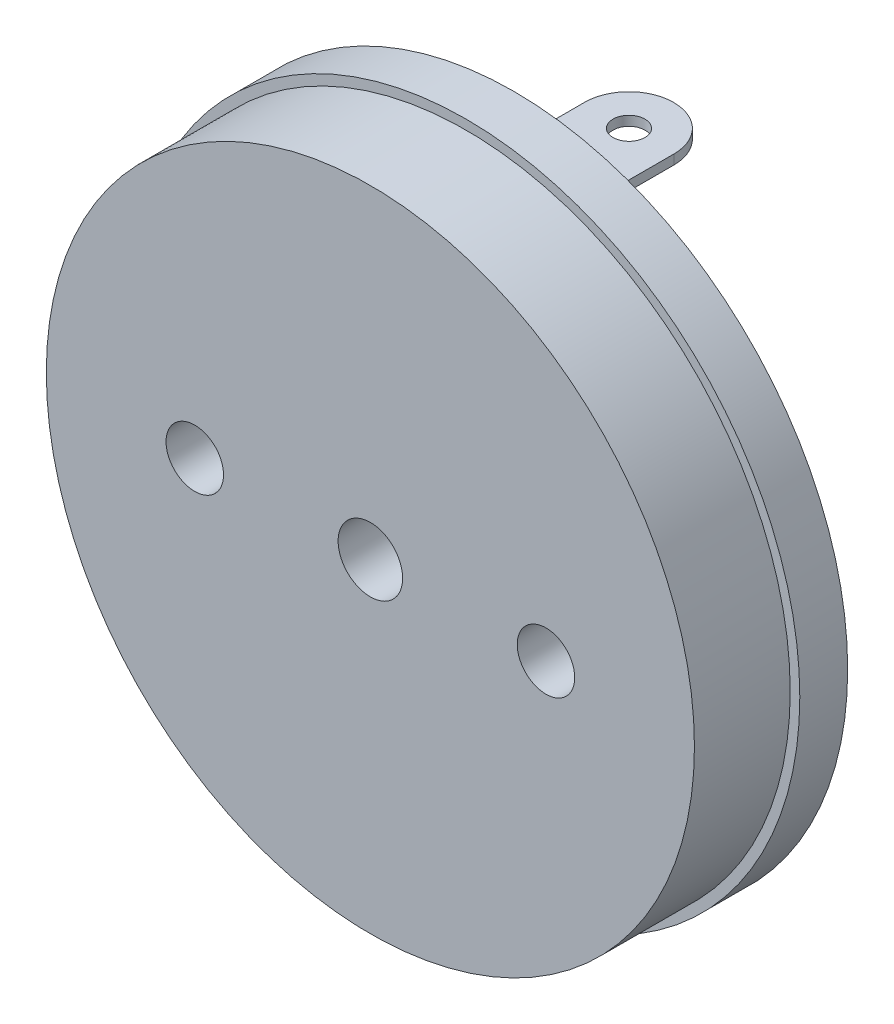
ISO-10303-21;
HEADER;
FILE_DESCRIPTION(('STEP AP214'),'2;1');
FILE_NAME('part.step','',(''),(''),'','','');
FILE_SCHEMA(('AUTOMOTIVE_DESIGN { 1 0 10303 214 1 1 1 1 }'));
ENDSEC;
DATA;
#1=APPLICATION_CONTEXT('core data for automotive mechanical design processes');
#2=APPLICATION_PROTOCOL_DEFINITION('international standard','automotive_design',2000,#1);
#3=PRODUCT_CONTEXT('',#1,'mechanical');
#4=PRODUCT('Part','Part','',(#3));
#5=PRODUCT_RELATED_PRODUCT_CATEGORY('part','',(#4));
#6=PRODUCT_DEFINITION_FORMATION('','',#4);
#7=PRODUCT_DEFINITION_CONTEXT('part definition',#1,'design');
#8=PRODUCT_DEFINITION('design','',#6,#7);
#9=PRODUCT_DEFINITION_SHAPE('','',#8);
#10=(LENGTH_UNIT() NAMED_UNIT(*) SI_UNIT(.MILLI.,.METRE.));
#11=(NAMED_UNIT(*) PLANE_ANGLE_UNIT() SI_UNIT($,.RADIAN.));
#12=(NAMED_UNIT(*) SI_UNIT($,.STERADIAN.) SOLID_ANGLE_UNIT());
#13=UNCERTAINTY_MEASURE_WITH_UNIT(LENGTH_MEASURE(1.E-05),#10,'distance_accuracy_value','');
#14=(GEOMETRIC_REPRESENTATION_CONTEXT(3) GLOBAL_UNCERTAINTY_ASSIGNED_CONTEXT((#13)) GLOBAL_UNIT_ASSIGNED_CONTEXT((#10,
#11,#12)) REPRESENTATION_CONTEXT('',''));
#15=CARTESIAN_POINT('',(0.,0.,0.));
#16=DIRECTION('',(0.,0.,1.));
#17=DIRECTION('',(1.,0.,0.));
#18=AXIS2_PLACEMENT_3D('',#15,#16,#17);
#19=CARTESIAN_POINT('',(0.,0.,0.));
#20=DIRECTION('',(0.,0.,0.999999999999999));
#21=DIRECTION('',(0.999999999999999,0.,0.));
#22=AXIS2_PLACEMENT_3D('',#19,#20,#21);
#23=PLANE('',#22);
#24=DIRECTION('',(1.,0.,0.));
#25=VECTOR('',#24,1.);
#26=CARTESIAN_POINT('',(2.81635245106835,-5.66058957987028,0.));
#27=LINE('',#26,#25);
#28=CARTESIAN_POINT('',(2.81635245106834,-5.66058957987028,0.));
#29=VERTEX_POINT('',#28);
#30=CARTESIAN_POINT('',(4.93558795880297,-5.66058957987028,0.));
#31=VERTEX_POINT('',#30);
#32=EDGE_CURVE('E156',#29,#31,#27,.T.);
#33=ORIENTED_EDGE('',*,*,#32,.F.);
#34=DIRECTION('',(0.,1.,0.));
#35=VECTOR('',#34,1.);
#36=CARTESIAN_POINT('',(2.81635245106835,-7.91924847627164,0.));
#37=LINE('',#36,#35);
#38=CARTESIAN_POINT('',(2.81635245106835,-7.91924847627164,0.));
#39=VERTEX_POINT('',#38);
#40=EDGE_CURVE('E44',#39,#29,#37,.T.);
#41=ORIENTED_EDGE('',*,*,#40,.F.);
#42=DIRECTION('',(-1.,0.,0.));
#43=VECTOR('',#42,1.);
#44=CARTESIAN_POINT('',(2.81635245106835,-7.91924847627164,0.));
#45=LINE('',#44,#43);
#46=CARTESIAN_POINT('',(4.93558795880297,-7.91924847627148,0.));
#47=VERTEX_POINT('',#46);
#48=EDGE_CURVE('E162',#47,#39,#45,.T.);
#49=ORIENTED_EDGE('',*,*,#48,.F.);
#50=DIRECTION('',(0.,-1.,0.));
#51=VECTOR('',#50,1.);
#52=CARTESIAN_POINT('',(4.93558795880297,-7.91924847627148,0.));
#53=LINE('',#52,#51);
#54=EDGE_CURVE('E145',#31,#47,#53,.T.);
#55=ORIENTED_EDGE('',*,*,#54,.F.);
#56=EDGE_LOOP('',(#33,#41,#49,#55));
#57=FACE_BOUND('',#56,.T.);
#58=CARTESIAN_POINT('',(-3.62500810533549,7.08270814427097,-1.49186218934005E-13));
#59=DIRECTION('',(0.,0.,-1.));
#60=DIRECTION('',(-1.,0.,0.));
#61=AXIS2_PLACEMENT_3D('',#58,#59,#60);
#62=CIRCLE('',#61,1.1292433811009);
#63=CARTESIAN_POINT('',(-4.75425148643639,7.08270814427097,-1.64479988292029E-13));
#64=VERTEX_POINT('',#63);
#65=EDGE_CURVE('E178',#64,#64,#62,.T.);
#66=ORIENTED_EDGE('',*,*,#65,.F.);
#67=EDGE_LOOP('',(#66));
#68=FACE_BOUND('',#67,.T.);
#69=DIRECTION('',(-0.999999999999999,0.,0.));
#70=VECTOR('',#69,1.);
#71=CARTESIAN_POINT('',(1.40000000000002,-7.65000000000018,0.));
#72=LINE('',#71,#70);
#73=CARTESIAN_POINT('',(1.40000000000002,-7.65000000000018,0.));
#74=VERTEX_POINT('',#73);
#75=CARTESIAN_POINT('',(-1.39999999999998,-7.65,0.));
#76=VERTEX_POINT('',#75);
#77=EDGE_CURVE('E224',#74,#76,#72,.T.);
#78=ORIENTED_EDGE('',*,*,#77,.F.);
#79=DIRECTION('',(0.,-1.,0.));
#80=VECTOR('',#79,1.);
#81=CARTESIAN_POINT('',(1.40000000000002,-7.65000000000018,0.));
#82=LINE('',#81,#80);
#83=CARTESIAN_POINT('',(1.40000000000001,-7.35000000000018,0.));
#84=VERTEX_POINT('',#83);
#85=EDGE_CURVE('E233',#84,#74,#82,.T.);
#86=ORIENTED_EDGE('',*,*,#85,.F.);
#87=DIRECTION('',(0.999999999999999,0.,0.));
#88=VECTOR('',#87,1.);
#89=CARTESIAN_POINT('',(1.40000000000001,-7.35000000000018,0.));
#90=LINE('',#89,#88);
#91=CARTESIAN_POINT('',(-1.39999999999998,-7.35000000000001,1.59594559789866E-13));
#92=VERTEX_POINT('',#91);
#93=EDGE_CURVE('E230',#92,#84,#90,.T.);
#94=ORIENTED_EDGE('',*,*,#93,.F.);
#95=DIRECTION('',(0.,1.,0.));
#96=VECTOR('',#95,1.);
#97=CARTESIAN_POINT('',(-1.39999999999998,-7.65,0.));
#98=LINE('',#97,#96);
#99=EDGE_CURVE('E227',#76,#92,#98,.T.);
#100=ORIENTED_EDGE('',*,*,#99,.F.);
#101=EDGE_LOOP('',(#78,#86,#94,#100));
#102=FACE_BOUND('',#101,.T.);
#103=CARTESIAN_POINT('',(0.,0.,0.));
#104=DIRECTION('',(0.,0.,0.999999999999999));
#105=DIRECTION('',(0.999999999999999,0.,0.));
#106=AXIS2_PLACEMENT_3D('',#103,#104,#105);
#107=CIRCLE('',#106,10.45);
#108=CARTESIAN_POINT('',(-10.45,0.,-2.24646690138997E-13));
#109=VERTEX_POINT('',#108);
#110=EDGE_CURVE('E277',#109,#109,#107,.T.);
#111=ORIENTED_EDGE('',*,*,#110,.F.);
#112=EDGE_LOOP('',(#111));
#113=FACE_BOUND('',#112,.T.);
#114=CARTESIAN_POINT('',(-5.49999999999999,0.,0.));
#115=DIRECTION('',(0.,0.,0.999999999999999));
#116=DIRECTION('',(0.999999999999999,0.,0.));
#117=AXIS2_PLACEMENT_3D('',#114,#115,#116);
#118=CIRCLE('',#117,0.899999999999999);
#119=CARTESIAN_POINT('',(-4.59999999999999,0.,0.));
#120=VERTEX_POINT('',#119);
#121=EDGE_CURVE('E268',#120,#120,#118,.T.);
#122=ORIENTED_EDGE('',*,*,#121,.T.);
#123=EDGE_LOOP('',(#122));
#124=FACE_BOUND('',#123,.T.);
#125=CARTESIAN_POINT('',(5.49999999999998,0.,0.));
#126=DIRECTION('',(0.,0.,0.999999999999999));
#127=DIRECTION('',(-0.999999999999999,0.,0.));
#128=AXIS2_PLACEMENT_3D('',#125,#126,#127);
#129=CIRCLE('',#128,0.899999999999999);
#130=CARTESIAN_POINT('',(6.39999999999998,0.,0.));
#131=VERTEX_POINT('',#130);
#132=EDGE_CURVE('E262',#131,#131,#129,.T.);
#133=ORIENTED_EDGE('',*,*,#132,.T.);
#134=EDGE_LOOP('',(#133));
#135=FACE_BOUND('',#134,.T.);
#136=CARTESIAN_POINT('',(0.,0.,0.));
#137=DIRECTION('',(0.,0.,0.999999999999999));
#138=DIRECTION('',(0.999999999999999,0.,0.));
#139=AXIS2_PLACEMENT_3D('',#136,#137,#138);
#140=CIRCLE('',#139,3.08);
#141=CARTESIAN_POINT('',(3.07999999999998,0.,0.));
#142=VERTEX_POINT('',#141);
#143=EDGE_CURVE('E283',#142,#142,#140,.F.);
#144=ORIENTED_EDGE('',*,*,#143,.F.);
#145=EDGE_LOOP('',(#144));
#146=FACE_BOUND('',#145,.T.);
#147=DIRECTION('',(0.,-1.,0.));
#148=VECTOR('',#147,1.);
#149=CARTESIAN_POINT('',(1.40000000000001,7.65000000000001,0.));
#150=LINE('',#149,#148);
#151=CARTESIAN_POINT('',(1.40000000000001,7.65000000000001,0.));
#152=VERTEX_POINT('',#151);
#153=CARTESIAN_POINT('',(1.39999999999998,7.35,-1.04083408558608E-13));
#154=VERTEX_POINT('',#153);
#155=EDGE_CURVE('E198',#152,#154,#150,.T.);
#156=ORIENTED_EDGE('',*,*,#155,.F.);
#157=DIRECTION('',(0.999999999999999,0.,0.));
#158=VECTOR('',#157,1.);
#159=CARTESIAN_POINT('',(1.40000000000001,7.65000000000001,0.));
#160=LINE('',#159,#158);
#161=CARTESIAN_POINT('',(-1.4,7.65000000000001,0.));
#162=VERTEX_POINT('',#161);
#163=EDGE_CURVE('E207',#162,#152,#160,.T.);
#164=ORIENTED_EDGE('',*,*,#163,.F.);
#165=DIRECTION('',(0.,1.,0.));
#166=VECTOR('',#165,1.);
#167=CARTESIAN_POINT('',(-1.4,7.65000000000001,0.));
#168=LINE('',#167,#166);
#169=CARTESIAN_POINT('',(-1.40000000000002,7.35000000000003,0.));
#170=VERTEX_POINT('',#169);
#171=EDGE_CURVE('E204',#170,#162,#168,.T.);
#172=ORIENTED_EDGE('',*,*,#171,.F.);
#173=DIRECTION('',(-0.999999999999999,0.,0.));
#174=VECTOR('',#173,1.);
#175=CARTESIAN_POINT('',(1.39999999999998,7.35,-1.04083408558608E-13));
#176=LINE('',#175,#174);
#177=EDGE_CURVE('E201',#154,#170,#176,.T.);
#178=ORIENTED_EDGE('',*,*,#177,.F.);
#179=EDGE_LOOP('',(#156,#164,#172,#178));
#180=FACE_BOUND('',#179,.T.);
#181=ADVANCED_FACE('F29',(#57,#68,#102,#113,#124,#135,#146,#180),#23,.F.);
#182=CARTESIAN_POINT('',(0.,0.,1.49999999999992));
#183=DIRECTION('',(0.,0.,0.999999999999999));
#184=DIRECTION('',(0.999999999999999,0.,0.));
#185=AXIS2_PLACEMENT_3D('',#182,#183,#184);
#186=PLANE('',#185);
#187=CARTESIAN_POINT('',(0.,0.,1.49999999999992));
#188=DIRECTION('',(0.,0.,0.999999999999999));
#189=DIRECTION('',(0.999999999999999,0.,0.));
#190=AXIS2_PLACEMENT_3D('',#187,#188,#189);
#191=CIRCLE('',#190,10.45);
#192=CARTESIAN_POINT('',(-10.45,0.,1.49999999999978));
#193=VERTEX_POINT('',#192);
#194=EDGE_CURVE('E280',#193,#193,#191,.T.);
#195=ORIENTED_EDGE('',*,*,#194,.T.);
#196=EDGE_LOOP('',(#195));
#197=FACE_BOUND('',#196,.T.);
#198=CARTESIAN_POINT('',(0.,0.,1.49999999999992));
#199=DIRECTION('',(0.,0.,0.999999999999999));
#200=DIRECTION('',(0.999999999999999,0.,0.));
#201=AXIS2_PLACEMENT_3D('',#198,#199,#200);
#202=CIRCLE('',#201,10.15);
#203=CARTESIAN_POINT('',(-10.15,0.,1.49999999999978));
#204=VERTEX_POINT('',#203);
#205=EDGE_CURVE('E271',#204,#204,#202,.T.);
#206=ORIENTED_EDGE('',*,*,#205,.F.);
#207=EDGE_LOOP('',(#206));
#208=FACE_BOUND('',#207,.T.);
#209=ADVANCED_FACE('F358',(#197,#208),#186,.T.);
#210=CARTESIAN_POINT('',(0.,0.,1.49999999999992));
#211=DIRECTION('',(0.,0.,-0.999999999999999));
#212=DIRECTION('',(-0.999999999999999,0.,0.));
#213=AXIS2_PLACEMENT_3D('',#210,#211,#212);
#214=CYLINDRICAL_SURFACE('',#213,10.45);
#215=CARTESIAN_POINT('',(-10.45,0.,1.49999999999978));
#216=CARTESIAN_POINT('',(-10.45,0.,1.48437499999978));
#217=CARTESIAN_POINT('',(-10.45,0.,1.46874999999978));
#218=CARTESIAN_POINT('',(-10.45,0.,1.43749999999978));
#219=CARTESIAN_POINT('',(-10.45,0.,1.42187499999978));
#220=CARTESIAN_POINT('',(-10.45,0.,1.39062499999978));
#221=CARTESIAN_POINT('',(-10.45,0.,1.37499999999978));
#222=CARTESIAN_POINT('',(-10.45,0.,1.34374999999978));
#223=CARTESIAN_POINT('',(-10.45,0.,1.32812499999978));
#224=CARTESIAN_POINT('',(-10.45,0.,1.29687499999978));
#225=CARTESIAN_POINT('',(-10.45,0.,1.28124999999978));
#226=CARTESIAN_POINT('',(-10.45,0.,1.24999999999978));
#227=CARTESIAN_POINT('',(-10.45,0.,1.23437499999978));
#228=CARTESIAN_POINT('',(-10.45,0.,1.20312499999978));
#229=CARTESIAN_POINT('',(-10.45,0.,1.18749999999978));
#230=CARTESIAN_POINT('',(-10.45,0.,1.15624999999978));
#231=CARTESIAN_POINT('',(-10.45,0.,1.14062499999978));
#232=CARTESIAN_POINT('',(-10.45,0.,1.10937499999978));
#233=CARTESIAN_POINT('',(-10.45,0.,1.09374999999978));
#234=CARTESIAN_POINT('',(-10.45,0.,1.06249999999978));
#235=CARTESIAN_POINT('',(-10.45,0.,1.04687499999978));
#236=CARTESIAN_POINT('',(-10.45,0.,1.01562499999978));
#237=CARTESIAN_POINT('',(-10.45,0.,0.999999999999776));
#238=CARTESIAN_POINT('',(-10.45,0.,0.968749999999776));
#239=CARTESIAN_POINT('',(-10.45,0.,0.953124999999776));
#240=CARTESIAN_POINT('',(-10.45,0.,0.921874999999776));
#241=CARTESIAN_POINT('',(-10.45,0.,0.906249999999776));
#242=CARTESIAN_POINT('',(-10.45,0.,0.874999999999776));
#243=CARTESIAN_POINT('',(-10.45,0.,0.859374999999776));
#244=CARTESIAN_POINT('',(-10.45,0.,0.828124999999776));
#245=CARTESIAN_POINT('',(-10.45,0.,0.812499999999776));
#246=CARTESIAN_POINT('',(-10.45,0.,0.781249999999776));
#247=CARTESIAN_POINT('',(-10.45,0.,0.765624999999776));
#248=CARTESIAN_POINT('',(-10.45,0.,0.734374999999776));
#249=CARTESIAN_POINT('',(-10.45,0.,0.718749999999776));
#250=CARTESIAN_POINT('',(-10.45,0.,0.687499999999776));
#251=CARTESIAN_POINT('',(-10.45,0.,0.671874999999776));
#252=CARTESIAN_POINT('',(-10.45,0.,0.640624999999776));
#253=CARTESIAN_POINT('',(-10.45,0.,0.624999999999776));
#254=CARTESIAN_POINT('',(-10.45,0.,0.593749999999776));
#255=CARTESIAN_POINT('',(-10.45,0.,0.578124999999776));
#256=CARTESIAN_POINT('',(-10.45,0.,0.546874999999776));
#257=CARTESIAN_POINT('',(-10.45,0.,0.531249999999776));
#258=CARTESIAN_POINT('',(-10.45,0.,0.499999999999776));
#259=CARTESIAN_POINT('',(-10.45,0.,0.484374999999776));
#260=CARTESIAN_POINT('',(-10.45,0.,0.453124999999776));
#261=CARTESIAN_POINT('',(-10.45,0.,0.437499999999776));
#262=CARTESIAN_POINT('',(-10.45,0.,0.406249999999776));
#263=CARTESIAN_POINT('',(-10.45,0.,0.390624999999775));
#264=CARTESIAN_POINT('',(-10.45,0.,0.359374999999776));
#265=CARTESIAN_POINT('',(-10.45,0.,0.343749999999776));
#266=CARTESIAN_POINT('',(-10.45,0.,0.312499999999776));
#267=CARTESIAN_POINT('',(-10.45,0.,0.296874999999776));
#268=CARTESIAN_POINT('',(-10.45,0.,0.265624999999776));
#269=CARTESIAN_POINT('',(-10.45,0.,0.249999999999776));
#270=CARTESIAN_POINT('',(-10.45,0.,0.218749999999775));
#271=CARTESIAN_POINT('',(-10.45,0.,0.203124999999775));
#272=CARTESIAN_POINT('',(-10.45,0.,0.171874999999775));
#273=CARTESIAN_POINT('',(-10.45,0.,0.156249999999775));
#274=CARTESIAN_POINT('',(-10.45,0.,0.124999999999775));
#275=CARTESIAN_POINT('',(-10.45,0.,0.109374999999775));
#276=CARTESIAN_POINT('',(-10.45,0.,0.0781249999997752));
#277=CARTESIAN_POINT('',(-10.45,0.,0.0624999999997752));
#278=CARTESIAN_POINT('',(-10.45,0.,0.0312499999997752));
#279=CARTESIAN_POINT('',(-10.45,0.,0.0156249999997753));
#280=CARTESIAN_POINT('',(-10.45,0.,-2.24646690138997E-13));
#281=B_SPLINE_CURVE_WITH_KNOTS('',3,(#215,#216,#217,#218,#219,#220,#221,#222,#223,#224,#225,
#226,#227,#228,#229,#230,#231,#232,#233,#234,#235,#236,#237,#238,#239,#240,#241,#242,#243,#244,
#245,#246,#247,#248,#249,#250,#251,#252,#253,#254,#255,#256,#257,#258,#259,#260,#261,#262,#263,
#264,#265,#266,#267,#268,#269,#270,#271,#272,#273,#274,#275,#276,#277,#278,#279,#280),
.UNSPECIFIED.,.F.,.F.,(4,2,2,2,2,2,2,2,2,2,2,2,2,2,2,2,2,2,2,2,2,2,2,2,2,2,2,2,2,2,2,2,4),(0.,
0.0468749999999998,0.0937499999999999,0.140625,0.1875,0.234375,0.28125,0.328125,0.375,0.421875,
0.46875,0.515625,0.5625,0.609375,0.65625,0.703125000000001,0.75,0.796875,0.843750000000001,
0.890625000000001,0.937500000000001,0.984375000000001,1.03125,1.078125,1.125,1.171875,1.21875,
1.265625,1.3125,1.359375,1.40625,1.453125,1.5),.UNSPECIFIED.);
#282=EDGE_CURVE('BSEAM31',#193,#109,#281,.T.);
#283=ORIENTED_EDGE('',*,*,#194,.F.);
#284=ORIENTED_EDGE('',*,*,#110,.T.);
#285=ORIENTED_EDGE('',*,*,#282,.T.);
#286=ORIENTED_EDGE('',*,*,#282,.F.);
#287=EDGE_LOOP('',(#283,#285,#284,#286));
#288=FACE_BOUND('',#287,.T.);
#289=ADVANCED_FACE('F31',(#288),#214,.T.);
#290=CARTESIAN_POINT('',(0.,0.,4.49999999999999));
#291=DIRECTION('',(0.,0.,-0.999999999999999));
#292=DIRECTION('',(-0.999999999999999,0.,0.));
#293=AXIS2_PLACEMENT_3D('',#290,#291,#292);
#294=CYLINDRICAL_SURFACE('',#293,10.15);
#295=CARTESIAN_POINT('',(0.,0.,4.49999999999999));
#296=DIRECTION('',(0.,0.,0.999999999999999));
#297=DIRECTION('',(0.999999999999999,0.,0.));
#298=AXIS2_PLACEMENT_3D('',#295,#296,#297);
#299=CIRCLE('',#298,10.15);
#300=CARTESIAN_POINT('',(-10.15,0.,4.49999999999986));
#301=VERTEX_POINT('',#300);
#302=EDGE_CURVE('E274',#301,#301,#299,.T.);
#303=CARTESIAN_POINT('',(-10.15,0.,4.49999999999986));
#304=CARTESIAN_POINT('',(-10.15,0.,4.46874999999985));
#305=CARTESIAN_POINT('',(-10.15,0.,4.43749999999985));
#306=CARTESIAN_POINT('',(-10.15,0.,4.37499999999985));
#307=CARTESIAN_POINT('',(-10.15,0.,4.34374999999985));
#308=CARTESIAN_POINT('',(-10.15,0.,4.28124999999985));
#309=CARTESIAN_POINT('',(-10.15,0.,4.24999999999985));
#310=CARTESIAN_POINT('',(-10.15,0.,4.18749999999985));
#311=CARTESIAN_POINT('',(-10.15,0.,4.15624999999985));
#312=CARTESIAN_POINT('',(-10.15,0.,4.09374999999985));
#313=CARTESIAN_POINT('',(-10.15,0.,4.06249999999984));
#314=CARTESIAN_POINT('',(-10.15,0.,3.99999999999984));
#315=CARTESIAN_POINT('',(-10.15,0.,3.96874999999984));
#316=CARTESIAN_POINT('',(-10.15,0.,3.90624999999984));
#317=CARTESIAN_POINT('',(-10.15,0.,3.87499999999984));
#318=CARTESIAN_POINT('',(-10.15,0.,3.81249999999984));
#319=CARTESIAN_POINT('',(-10.15,0.,3.78124999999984));
#320=CARTESIAN_POINT('',(-10.15,0.,3.71874999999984));
#321=CARTESIAN_POINT('',(-10.15,0.,3.68749999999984));
#322=CARTESIAN_POINT('',(-10.15,0.,3.62499999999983));
#323=CARTESIAN_POINT('',(-10.15,0.,3.59374999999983));
#324=CARTESIAN_POINT('',(-10.15,0.,3.53124999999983));
#325=CARTESIAN_POINT('',(-10.15,0.,3.49999999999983));
#326=CARTESIAN_POINT('',(-10.15,0.,3.43749999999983));
#327=CARTESIAN_POINT('',(-10.15,0.,3.40624999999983));
#328=CARTESIAN_POINT('',(-10.15,0.,3.34374999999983));
#329=CARTESIAN_POINT('',(-10.15,0.,3.31249999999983));
#330=CARTESIAN_POINT('',(-10.15,0.,3.24999999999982));
#331=CARTESIAN_POINT('',(-10.15,0.,3.21874999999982));
#332=CARTESIAN_POINT('',(-10.15,0.,3.15624999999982));
#333=CARTESIAN_POINT('',(-10.15,0.,3.12499999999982));
#334=CARTESIAN_POINT('',(-10.15,0.,3.06249999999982));
#335=CARTESIAN_POINT('',(-10.15,0.,3.03124999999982));
#336=CARTESIAN_POINT('',(-10.15,0.,2.96874999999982));
#337=CARTESIAN_POINT('',(-10.15,0.,2.93749999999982));
#338=CARTESIAN_POINT('',(-10.15,0.,2.87499999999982));
#339=CARTESIAN_POINT('',(-10.15,0.,2.84374999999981));
#340=CARTESIAN_POINT('',(-10.15,0.,2.78124999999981));
#341=CARTESIAN_POINT('',(-10.15,0.,2.74999999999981));
#342=CARTESIAN_POINT('',(-10.15,0.,2.68749999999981));
#343=CARTESIAN_POINT('',(-10.15,0.,2.65624999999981));
#344=CARTESIAN_POINT('',(-10.15,0.,2.59374999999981));
#345=CARTESIAN_POINT('',(-10.15,0.,2.56249999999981));
#346=CARTESIAN_POINT('',(-10.15,0.,2.49999999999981));
#347=CARTESIAN_POINT('',(-10.15,0.,2.46874999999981));
#348=CARTESIAN_POINT('',(-10.15,0.,2.4062499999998));
#349=CARTESIAN_POINT('',(-10.15,0.,2.3749999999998));
#350=CARTESIAN_POINT('',(-10.15,0.,2.3124999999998));
#351=CARTESIAN_POINT('',(-10.15,0.,2.2812499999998));
#352=CARTESIAN_POINT('',(-10.15,0.,2.2187499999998));
#353=CARTESIAN_POINT('',(-10.15,0.,2.1874999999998));
#354=CARTESIAN_POINT('',(-10.15,0.,2.1249999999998));
#355=CARTESIAN_POINT('',(-10.15,0.,2.0937499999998));
#356=CARTESIAN_POINT('',(-10.15,0.,2.03124999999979));
#357=CARTESIAN_POINT('',(-10.15,0.,1.99999999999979));
#358=CARTESIAN_POINT('',(-10.15,0.,1.93749999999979));
#359=CARTESIAN_POINT('',(-10.15,0.,1.90624999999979));
#360=CARTESIAN_POINT('',(-10.15,0.,1.84374999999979));
#361=CARTESIAN_POINT('',(-10.15,0.,1.81249999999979));
#362=CARTESIAN_POINT('',(-10.15,0.,1.74999999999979));
#363=CARTESIAN_POINT('',(-10.15,0.,1.71874999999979));
#364=CARTESIAN_POINT('',(-10.15,0.,1.65624999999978));
#365=CARTESIAN_POINT('',(-10.15,0.,1.62499999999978));
#366=CARTESIAN_POINT('',(-10.15,0.,1.56249999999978));
#367=CARTESIAN_POINT('',(-10.15,0.,1.53124999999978));
#368=CARTESIAN_POINT('',(-10.15,0.,1.49999999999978));
#369=B_SPLINE_CURVE_WITH_KNOTS('',3,(#303,#304,#305,#306,#307,#308,#309,#310,#311,#312,#313,
#314,#315,#316,#317,#318,#319,#320,#321,#322,#323,#324,#325,#326,#327,#328,#329,#330,#331,#332,
#333,#334,#335,#336,#337,#338,#339,#340,#341,#342,#343,#344,#345,#346,#347,#348,#349,#350,#351,
#352,#353,#354,#355,#356,#357,#358,#359,#360,#361,#362,#363,#364,#365,#366,#367,#368),
.UNSPECIFIED.,.F.,.F.,(4,2,2,2,2,2,2,2,2,2,2,2,2,2,2,2,2,2,2,2,2,2,2,2,2,2,2,2,2,2,2,2,4),(0.,
0.0937500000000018,0.187500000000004,0.281250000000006,0.375000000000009,0.468750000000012,
0.562500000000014,0.656250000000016,0.750000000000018,0.843750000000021,0.937500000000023,
1.03125000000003,1.12500000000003,1.21875000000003,1.31250000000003,1.40625000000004,
1.50000000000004,1.59375000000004,1.68750000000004,1.78125000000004,1.87500000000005,
1.96875000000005,2.06250000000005,2.15625000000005,2.25000000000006,2.34375000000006,
2.43750000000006,2.53125000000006,2.62500000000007,2.71875000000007,2.81250000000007,
2.90625000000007,3.00000000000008),.UNSPECIFIED.);
#370=EDGE_CURVE('BSEAM365',#301,#204,#369,.T.);
#371=ORIENTED_EDGE('',*,*,#302,.F.);
#372=ORIENTED_EDGE('',*,*,#205,.T.);
#373=ORIENTED_EDGE('',*,*,#370,.T.);
#374=ORIENTED_EDGE('',*,*,#370,.F.);
#375=EDGE_LOOP('',(#371,#373,#372,#374));
#376=FACE_BOUND('',#375,.T.);
#377=ADVANCED_FACE('F365',(#376),#294,.T.);
#378=CARTESIAN_POINT('',(0.,0.,4.49999999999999));
#379=DIRECTION('',(0.,0.,0.999999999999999));
#380=DIRECTION('',(0.999999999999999,0.,0.));
#381=AXIS2_PLACEMENT_3D('',#378,#379,#380);
#382=PLANE('',#381);
#383=CARTESIAN_POINT('',(0.,0.,4.49999999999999));
#384=DIRECTION('',(0.,0.,0.999999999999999));
#385=DIRECTION('',(0.999999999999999,0.,0.));
#386=AXIS2_PLACEMENT_3D('',#383,#384,#385);
#387=CIRCLE('',#386,1.01);
#388=CARTESIAN_POINT('',(1.00999999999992,0.,4.50000000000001));
#389=VERTEX_POINT('',#388);
#390=EDGE_CURVE('E250',#389,#389,#387,.T.);
#391=ORIENTED_EDGE('',*,*,#390,.F.);
#392=EDGE_LOOP('',(#391));
#393=FACE_BOUND('',#392,.T.);
#394=CARTESIAN_POINT('',(5.49999999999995,0.,4.49999999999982));
#395=DIRECTION('',(0.,0.,0.999999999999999));
#396=DIRECTION('',(-0.999999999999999,0.,0.));
#397=AXIS2_PLACEMENT_3D('',#394,#395,#396);
#398=CIRCLE('',#397,0.899999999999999);
#399=CARTESIAN_POINT('',(6.39999999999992,0.,4.49999999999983));
#400=VERTEX_POINT('',#399);
#401=EDGE_CURVE('E259',#400,#400,#398,.T.);
#402=ORIENTED_EDGE('',*,*,#401,.F.);
#403=EDGE_LOOP('',(#402));
#404=FACE_BOUND('',#403,.T.);
#405=CARTESIAN_POINT('',(-5.5,0.,4.50000000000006));
#406=DIRECTION('',(0.,0.,0.999999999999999));
#407=DIRECTION('',(0.999999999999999,0.,0.));
#408=AXIS2_PLACEMENT_3D('',#405,#406,#407);
#409=CIRCLE('',#408,0.899999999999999);
#410=CARTESIAN_POINT('',(-4.60000000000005,0.,4.50000000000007));
#411=VERTEX_POINT('',#410);
#412=EDGE_CURVE('E265',#411,#411,#409,.T.);
#413=ORIENTED_EDGE('',*,*,#412,.F.);
#414=EDGE_LOOP('',(#413));
#415=FACE_BOUND('',#414,.T.);
#416=ORIENTED_EDGE('',*,*,#302,.T.);
#417=EDGE_LOOP('',(#416));
#418=FACE_BOUND('',#417,.T.);
#419=ADVANCED_FACE('F368',(#393,#404,#415,#418),#382,.T.);
#420=CARTESIAN_POINT('',(-5.49999999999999,0.,0.));
#421=DIRECTION('',(0.,0.,0.999999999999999));
#422=DIRECTION('',(0.999999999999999,0.,0.));
#423=AXIS2_PLACEMENT_3D('',#420,#421,#422);
#424=CYLINDRICAL_SURFACE('',#423,0.899999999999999);
#425=CARTESIAN_POINT('',(-4.59999999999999,0.,0.));
#426=CARTESIAN_POINT('',(-4.59999999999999,0.,0.0468749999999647));
#427=CARTESIAN_POINT('',(-4.59999999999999,0.,0.0937499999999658));
#428=CARTESIAN_POINT('',(-4.59999999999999,0.,0.187499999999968));
#429=CARTESIAN_POINT('',(-4.59999999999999,0.,0.234374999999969));
#430=CARTESIAN_POINT('',(-4.6,0.,0.328124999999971));
#431=CARTESIAN_POINT('',(-4.6,0.,0.374999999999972));
#432=CARTESIAN_POINT('',(-4.6,0.,0.468749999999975));
#433=CARTESIAN_POINT('',(-4.6,0.,0.515624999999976));
#434=CARTESIAN_POINT('',(-4.6,0.,0.609374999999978));
#435=CARTESIAN_POINT('',(-4.6,0.,0.656249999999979));
#436=CARTESIAN_POINT('',(-4.6,0.,0.749999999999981));
#437=CARTESIAN_POINT('',(-4.6,0.,0.796874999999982));
#438=CARTESIAN_POINT('',(-4.6,0.,0.890624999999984));
#439=CARTESIAN_POINT('',(-4.6,0.,0.937499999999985));
#440=CARTESIAN_POINT('',(-4.6,0.,1.03124999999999));
#441=CARTESIAN_POINT('',(-4.60000000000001,0.,1.07812499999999));
#442=CARTESIAN_POINT('',(-4.60000000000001,0.,1.17187499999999));
#443=CARTESIAN_POINT('',(-4.60000000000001,0.,1.21874999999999));
#444=CARTESIAN_POINT('',(-4.60000000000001,0.,1.31249999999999));
#445=CARTESIAN_POINT('',(-4.60000000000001,0.,1.359375));
#446=CARTESIAN_POINT('',(-4.60000000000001,0.,1.453125));
#447=CARTESIAN_POINT('',(-4.60000000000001,0.,1.5));
#448=CARTESIAN_POINT('',(-4.60000000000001,0.,1.59375));
#449=CARTESIAN_POINT('',(-4.60000000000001,0.,1.640625));
#450=CARTESIAN_POINT('',(-4.60000000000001,0.,1.734375));
#451=CARTESIAN_POINT('',(-4.60000000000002,0.,1.78125000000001));
#452=CARTESIAN_POINT('',(-4.60000000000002,0.,1.87500000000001));
#453=CARTESIAN_POINT('',(-4.60000000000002,0.,1.92187500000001));
#454=CARTESIAN_POINT('',(-4.60000000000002,0.,2.01562500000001));
#455=CARTESIAN_POINT('',(-4.60000000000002,0.,2.06250000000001));
#456=CARTESIAN_POINT('',(-4.60000000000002,0.,2.15625000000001));
#457=CARTESIAN_POINT('',(-4.60000000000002,0.,2.20312500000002));
#458=CARTESIAN_POINT('',(-4.60000000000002,0.,2.29687500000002));
#459=CARTESIAN_POINT('',(-4.60000000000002,0.,2.34375000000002));
#460=CARTESIAN_POINT('',(-4.60000000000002,0.,2.43750000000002));
#461=CARTESIAN_POINT('',(-4.60000000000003,0.,2.48437500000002));
#462=CARTESIAN_POINT('',(-4.60000000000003,0.,2.57812500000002));
#463=CARTESIAN_POINT('',(-4.60000000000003,0.,2.62500000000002));
#464=CARTESIAN_POINT('',(-4.60000000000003,0.,2.71875000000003));
#465=CARTESIAN_POINT('',(-4.60000000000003,0.,2.76562500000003));
#466=CARTESIAN_POINT('',(-4.60000000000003,0.,2.85937500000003));
#467=CARTESIAN_POINT('',(-4.60000000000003,0.,2.90625000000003));
#468=CARTESIAN_POINT('',(-4.60000000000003,0.,3.00000000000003));
#469=CARTESIAN_POINT('',(-4.60000000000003,0.,3.04687500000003));
#470=CARTESIAN_POINT('',(-4.60000000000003,0.,3.14062500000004));
#471=CARTESIAN_POINT('',(-4.60000000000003,0.,3.18750000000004));
#472=CARTESIAN_POINT('',(-4.60000000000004,0.,3.28125000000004));
#473=CARTESIAN_POINT('',(-4.60000000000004,0.,3.32812500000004));
#474=CARTESIAN_POINT('',(-4.60000000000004,0.,3.42187500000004));
#475=CARTESIAN_POINT('',(-4.60000000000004,0.,3.46875000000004));
#476=CARTESIAN_POINT('',(-4.60000000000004,0.,3.56250000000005));
#477=CARTESIAN_POINT('',(-4.60000000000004,0.,3.60937500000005));
#478=CARTESIAN_POINT('',(-4.60000000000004,0.,3.70312500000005));
#479=CARTESIAN_POINT('',(-4.60000000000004,0.,3.75000000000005));
#480=CARTESIAN_POINT('',(-4.60000000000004,0.,3.84375000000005));
#481=CARTESIAN_POINT('',(-4.60000000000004,0.,3.89062500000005));
#482=CARTESIAN_POINT('',(-4.60000000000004,0.,3.98437500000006));
#483=CARTESIAN_POINT('',(-4.60000000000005,0.,4.03125000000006));
#484=CARTESIAN_POINT('',(-4.60000000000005,0.,4.12500000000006));
#485=CARTESIAN_POINT('',(-4.60000000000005,0.,4.17187500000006));
#486=CARTESIAN_POINT('',(-4.60000000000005,0.,4.26562500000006));
#487=CARTESIAN_POINT('',(-4.60000000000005,0.,4.31250000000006));
#488=CARTESIAN_POINT('',(-4.60000000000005,0.,4.40625000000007));
#489=CARTESIAN_POINT('',(-4.60000000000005,0.,4.45312500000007));
#490=CARTESIAN_POINT('',(-4.60000000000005,0.,4.50000000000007));
#491=B_SPLINE_CURVE_WITH_KNOTS('',3,(#425,#426,#427,#428,#429,#430,#431,#432,#433,#434,#435,
#436,#437,#438,#439,#440,#441,#442,#443,#444,#445,#446,#447,#448,#449,#450,#451,#452,#453,#454,
#455,#456,#457,#458,#459,#460,#461,#462,#463,#464,#465,#466,#467,#468,#469,#470,#471,#472,#473,
#474,#475,#476,#477,#478,#479,#480,#481,#482,#483,#484,#485,#486,#487,#488,#489,#490),
.UNSPECIFIED.,.F.,.F.,(4,2,2,2,2,2,2,2,2,2,2,2,2,2,2,2,2,2,2,2,2,2,2,2,2,2,2,2,2,2,2,2,4),(0.,
0.140625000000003,0.281250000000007,0.42187500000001,0.562500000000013,0.703125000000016,
0.84375000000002,0.984375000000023,1.12500000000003,1.26562500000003,1.40625000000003,
1.54687500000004,1.68750000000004,1.82812500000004,1.96875000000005,2.10937500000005,
2.25000000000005,2.39062500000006,2.53125000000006,2.67187500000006,2.81250000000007,
2.95312500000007,3.09375000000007,3.23437500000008,3.37500000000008,3.51562500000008,
3.65625000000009,3.79687500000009,3.93750000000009,4.0781250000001,4.2187500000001,
4.3593750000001,4.50000000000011),.UNSPECIFIED.);
#492=EDGE_CURVE('BSEAM372',#120,#411,#491,.T.);
#493=ORIENTED_EDGE('',*,*,#121,.F.);
#494=ORIENTED_EDGE('',*,*,#412,.T.);
#495=ORIENTED_EDGE('',*,*,#492,.T.);
#496=ORIENTED_EDGE('',*,*,#492,.F.);
#497=EDGE_LOOP('',(#493,#495,#494,#496));
#498=FACE_BOUND('',#497,.T.);
#499=ADVANCED_FACE('F372',(#498),#424,.F.);
#500=CARTESIAN_POINT('',(5.49999999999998,0.,0.));
#501=DIRECTION('',(0.,0.,0.999999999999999));
#502=DIRECTION('',(0.999999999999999,0.,0.));
#503=AXIS2_PLACEMENT_3D('',#500,#501,#502);
#504=CYLINDRICAL_SURFACE('',#503,0.899999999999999);
#505=CARTESIAN_POINT('',(6.39999999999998,0.,0.));
#506=CARTESIAN_POINT('',(6.39999999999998,0.,0.0468749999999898));
#507=CARTESIAN_POINT('',(6.39999999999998,0.,0.0937499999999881));
#508=CARTESIAN_POINT('',(6.39999999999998,0.,0.187499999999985));
#509=CARTESIAN_POINT('',(6.39999999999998,0.,0.234374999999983));
#510=CARTESIAN_POINT('',(6.39999999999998,0.,0.32812499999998));
#511=CARTESIAN_POINT('',(6.39999999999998,0.,0.374999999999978));
#512=CARTESIAN_POINT('',(6.39999999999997,0.,0.468749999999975));
#513=CARTESIAN_POINT('',(6.39999999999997,0.,0.515624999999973));
#514=CARTESIAN_POINT('',(6.39999999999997,0.,0.60937499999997));
#515=CARTESIAN_POINT('',(6.39999999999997,0.,0.656249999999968));
#516=CARTESIAN_POINT('',(6.39999999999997,0.,0.749999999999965));
#517=CARTESIAN_POINT('',(6.39999999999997,0.,0.796874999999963));
#518=CARTESIAN_POINT('',(6.39999999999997,0.,0.89062499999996));
#519=CARTESIAN_POINT('',(6.39999999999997,0.,0.937499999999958));
#520=CARTESIAN_POINT('',(6.39999999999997,0.,1.03124999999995));
#521=CARTESIAN_POINT('',(6.39999999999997,0.,1.07812499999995));
#522=CARTESIAN_POINT('',(6.39999999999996,0.,1.17187499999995));
#523=CARTESIAN_POINT('',(6.39999999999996,0.,1.21874999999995));
#524=CARTESIAN_POINT('',(6.39999999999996,0.,1.31249999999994));
#525=CARTESIAN_POINT('',(6.39999999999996,0.,1.35937499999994));
#526=CARTESIAN_POINT('',(6.39999999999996,0.,1.45312499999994));
#527=CARTESIAN_POINT('',(6.39999999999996,0.,1.49999999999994));
#528=CARTESIAN_POINT('',(6.39999999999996,0.,1.59374999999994));
#529=CARTESIAN_POINT('',(6.39999999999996,0.,1.64062499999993));
#530=CARTESIAN_POINT('',(6.39999999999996,0.,1.73437499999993));
#531=CARTESIAN_POINT('',(6.39999999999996,0.,1.78124999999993));
#532=CARTESIAN_POINT('',(6.39999999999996,0.,1.87499999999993));
#533=CARTESIAN_POINT('',(6.39999999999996,0.,1.92187499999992));
#534=CARTESIAN_POINT('',(6.39999999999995,0.,2.01562499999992));
#535=CARTESIAN_POINT('',(6.39999999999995,0.,2.06249999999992));
#536=CARTESIAN_POINT('',(6.39999999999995,0.,2.15624999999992));
#537=CARTESIAN_POINT('',(6.39999999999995,0.,2.20312499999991));
#538=CARTESIAN_POINT('',(6.39999999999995,0.,2.29687499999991));
#539=CARTESIAN_POINT('',(6.39999999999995,0.,2.34374999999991));
#540=CARTESIAN_POINT('',(6.39999999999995,0.,2.4374999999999));
#541=CARTESIAN_POINT('',(6.39999999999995,0.,2.4843749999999));
#542=CARTESIAN_POINT('',(6.39999999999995,0.,2.5781249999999));
#543=CARTESIAN_POINT('',(6.39999999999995,0.,2.6249999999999));
#544=CARTESIAN_POINT('',(6.39999999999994,0.,2.7187499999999));
#545=CARTESIAN_POINT('',(6.39999999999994,0.,2.76562499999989));
#546=CARTESIAN_POINT('',(6.39999999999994,0.,2.85937499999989));
#547=CARTESIAN_POINT('',(6.39999999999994,0.,2.90624999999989));
#548=CARTESIAN_POINT('',(6.39999999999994,0.,2.99999999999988));
#549=CARTESIAN_POINT('',(6.39999999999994,0.,3.04687499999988));
#550=CARTESIAN_POINT('',(6.39999999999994,0.,3.14062499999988));
#551=CARTESIAN_POINT('',(6.39999999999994,0.,3.18749999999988));
#552=CARTESIAN_POINT('',(6.39999999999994,0.,3.28124999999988));
#553=CARTESIAN_POINT('',(6.39999999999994,0.,3.32812499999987));
#554=CARTESIAN_POINT('',(6.39999999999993,0.,3.42187499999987));
#555=CARTESIAN_POINT('',(6.39999999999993,0.,3.46874999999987));
#556=CARTESIAN_POINT('',(6.39999999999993,0.,3.56249999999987));
#557=CARTESIAN_POINT('',(6.39999999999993,0.,3.60937499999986));
#558=CARTESIAN_POINT('',(6.39999999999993,0.,3.70312499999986));
#559=CARTESIAN_POINT('',(6.39999999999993,0.,3.74999999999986));
#560=CARTESIAN_POINT('',(6.39999999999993,0.,3.84374999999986));
#561=CARTESIAN_POINT('',(6.39999999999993,0.,3.89062499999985));
#562=CARTESIAN_POINT('',(6.39999999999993,0.,3.98437499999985));
#563=CARTESIAN_POINT('',(6.39999999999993,0.,4.03124999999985));
#564=CARTESIAN_POINT('',(6.39999999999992,0.,4.12499999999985));
#565=CARTESIAN_POINT('',(6.39999999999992,0.,4.17187499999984));
#566=CARTESIAN_POINT('',(6.39999999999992,0.,4.26562499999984));
#567=CARTESIAN_POINT('',(6.39999999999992,0.,4.31249999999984));
#568=CARTESIAN_POINT('',(6.39999999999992,0.,4.40624999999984));
#569=CARTESIAN_POINT('',(6.39999999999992,0.,4.45312499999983));
#570=CARTESIAN_POINT('',(6.39999999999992,0.,4.49999999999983));
#571=B_SPLINE_CURVE_WITH_KNOTS('',3,(#505,#506,#507,#508,#509,#510,#511,#512,#513,#514,#515,
#516,#517,#518,#519,#520,#521,#522,#523,#524,#525,#526,#527,#528,#529,#530,#531,#532,#533,#534,
#535,#536,#537,#538,#539,#540,#541,#542,#543,#544,#545,#546,#547,#548,#549,#550,#551,#552,#553,
#554,#555,#556,#557,#558,#559,#560,#561,#562,#563,#564,#565,#566,#567,#568,#569,#570),
.UNSPECIFIED.,.F.,.F.,(4,2,2,2,2,2,2,2,2,2,2,2,2,2,2,2,2,2,2,2,2,2,2,2,2,2,2,2,2,2,2,2,4),(0.,
0.140624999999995,0.28124999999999,0.421874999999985,0.56249999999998,0.703124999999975,
0.84374999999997,0.984374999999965,1.12499999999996,1.26562499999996,1.40624999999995,
1.54687499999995,1.68749999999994,1.82812499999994,1.96874999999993,2.10937499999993,
2.24999999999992,2.39062499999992,2.53124999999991,2.67187499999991,2.8124999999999,
2.9531249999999,3.09374999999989,3.23437499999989,3.37499999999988,3.51562499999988,
3.65624999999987,3.79687499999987,3.93749999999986,4.07812499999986,4.21874999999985,
4.35937499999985,4.49999999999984),.UNSPECIFIED.);
#572=EDGE_CURVE('BSEAM376',#131,#400,#571,.T.);
#573=ORIENTED_EDGE('',*,*,#132,.F.);
#574=ORIENTED_EDGE('',*,*,#401,.T.);
#575=ORIENTED_EDGE('',*,*,#572,.T.);
#576=ORIENTED_EDGE('',*,*,#572,.F.);
#577=EDGE_LOOP('',(#573,#575,#574,#576));
#578=FACE_BOUND('',#577,.T.);
#579=ADVANCED_FACE('F376',(#578),#504,.F.);
#580=CARTESIAN_POINT('',(0.,0.,-2.00000000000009));
#581=DIRECTION('',(0.,0.,0.999999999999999));
#582=DIRECTION('',(0.999999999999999,0.,0.));
#583=AXIS2_PLACEMENT_3D('',#580,#581,#582);
#584=CYLINDRICAL_SURFACE('',#583,3.08);
#585=CARTESIAN_POINT('',(0.,0.,-2.00000000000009));
#586=DIRECTION('',(0.,0.,-0.999999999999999));
#587=DIRECTION('',(-0.999999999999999,0.,0.));
#588=AXIS2_PLACEMENT_3D('',#585,#586,#587);
#589=CIRCLE('',#588,3.08);
#590=CARTESIAN_POINT('',(3.08000000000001,0.,-2.00000000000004));
#591=VERTEX_POINT('',#590);
#592=EDGE_CURVE('E256',#591,#591,#589,.T.);
#593=CARTESIAN_POINT('',(3.08000000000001,0.,-2.00000000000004));
#594=CARTESIAN_POINT('',(3.08000000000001,0.,-1.97916666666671));
#595=CARTESIAN_POINT('',(3.08000000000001,0.,-1.95833333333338));
#596=CARTESIAN_POINT('',(3.08000000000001,0.,-1.91666666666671));
#597=CARTESIAN_POINT('',(3.08000000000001,0.,-1.89583333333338));
#598=CARTESIAN_POINT('',(3.08000000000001,0.,-1.85416666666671));
#599=CARTESIAN_POINT('',(3.08000000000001,0.,-1.83333333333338));
#600=CARTESIAN_POINT('',(3.08,0.,-1.79166666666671));
#601=CARTESIAN_POINT('',(3.08,0.,-1.77083333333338));
#602=CARTESIAN_POINT('',(3.08,0.,-1.72916666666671));
#603=CARTESIAN_POINT('',(3.08,0.,-1.70833333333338));
#604=CARTESIAN_POINT('',(3.08,0.,-1.66666666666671));
#605=CARTESIAN_POINT('',(3.08,0.,-1.64583333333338));
#606=CARTESIAN_POINT('',(3.08,0.,-1.60416666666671));
#607=CARTESIAN_POINT('',(3.08,0.,-1.58333333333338));
#608=CARTESIAN_POINT('',(3.08,0.,-1.54166666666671));
#609=CARTESIAN_POINT('',(3.08,0.,-1.52083333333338));
#610=CARTESIAN_POINT('',(3.08,0.,-1.47916666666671));
#611=CARTESIAN_POINT('',(3.08,0.,-1.45833333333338));
#612=CARTESIAN_POINT('',(3.08,0.,-1.41666666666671));
#613=CARTESIAN_POINT('',(3.08,0.,-1.39583333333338));
#614=CARTESIAN_POINT('',(3.08,0.,-1.35416666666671));
#615=CARTESIAN_POINT('',(3.08,0.,-1.33333333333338));
#616=CARTESIAN_POINT('',(3.08,0.,-1.29166666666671));
#617=CARTESIAN_POINT('',(3.08,0.,-1.27083333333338));
#618=CARTESIAN_POINT('',(3.08,0.,-1.22916666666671));
#619=CARTESIAN_POINT('',(3.08,0.,-1.20833333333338));
#620=CARTESIAN_POINT('',(3.08,0.,-1.16666666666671));
#621=CARTESIAN_POINT('',(3.08,0.,-1.14583333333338));
#622=CARTESIAN_POINT('',(3.08,0.,-1.10416666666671));
#623=CARTESIAN_POINT('',(3.08,0.,-1.08333333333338));
#624=CARTESIAN_POINT('',(3.08,0.,-1.04166666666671));
#625=CARTESIAN_POINT('',(3.08,0.,-1.02083333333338));
#626=CARTESIAN_POINT('',(3.07999999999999,0.,-0.979166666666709));
#627=CARTESIAN_POINT('',(3.07999999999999,0.,-0.958333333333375));
#628=CARTESIAN_POINT('',(3.07999999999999,0.,-0.916666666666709));
#629=CARTESIAN_POINT('',(3.07999999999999,0.,-0.895833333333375));
#630=CARTESIAN_POINT('',(3.07999999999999,0.,-0.854166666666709));
#631=CARTESIAN_POINT('',(3.07999999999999,0.,-0.833333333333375));
#632=CARTESIAN_POINT('',(3.07999999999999,0.,-0.791666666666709));
#633=CARTESIAN_POINT('',(3.07999999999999,0.,-0.770833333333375));
#634=CARTESIAN_POINT('',(3.07999999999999,0.,-0.729166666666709));
#635=CARTESIAN_POINT('',(3.07999999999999,0.,-0.708333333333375));
#636=CARTESIAN_POINT('',(3.07999999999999,0.,-0.666666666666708));
#637=CARTESIAN_POINT('',(3.07999999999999,0.,-0.645833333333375));
#638=CARTESIAN_POINT('',(3.07999999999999,0.,-0.604166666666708));
#639=CARTESIAN_POINT('',(3.07999999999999,0.,-0.583333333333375));
#640=CARTESIAN_POINT('',(3.07999999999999,0.,-0.541666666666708));
#641=CARTESIAN_POINT('',(3.07999999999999,0.,-0.520833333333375));
#642=CARTESIAN_POINT('',(3.07999999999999,0.,-0.479166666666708));
#643=CARTESIAN_POINT('',(3.07999999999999,0.,-0.458333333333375));
#644=CARTESIAN_POINT('',(3.07999999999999,0.,-0.416666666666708));
#645=CARTESIAN_POINT('',(3.07999999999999,0.,-0.395833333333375));
#646=CARTESIAN_POINT('',(3.07999999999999,0.,-0.354166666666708));
#647=CARTESIAN_POINT('',(3.07999999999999,0.,-0.333333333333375));
#648=CARTESIAN_POINT('',(3.07999999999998,0.,-0.291666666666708));
#649=CARTESIAN_POINT('',(3.07999999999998,0.,-0.270833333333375));
#650=CARTESIAN_POINT('',(3.07999999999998,0.,-0.229166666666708));
#651=CARTESIAN_POINT('',(3.07999999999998,0.,-0.208333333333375));
#652=CARTESIAN_POINT('',(3.07999999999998,0.,-0.166666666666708));
#653=CARTESIAN_POINT('',(3.07999999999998,0.,-0.145833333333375));
#654=CARTESIAN_POINT('',(3.07999999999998,0.,-0.104166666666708));
#655=CARTESIAN_POINT('',(3.07999999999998,0.,-0.0833333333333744));
#656=CARTESIAN_POINT('',(3.07999999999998,0.,-0.0416666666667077));
#657=CARTESIAN_POINT('',(3.07999999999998,0.,-0.0208333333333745));
#658=CARTESIAN_POINT('',(3.07999999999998,0.,0.));
#659=B_SPLINE_CURVE_WITH_KNOTS('',3,(#593,#594,#595,#596,#597,#598,#599,#600,#601,#602,#603,
#604,#605,#606,#607,#608,#609,#610,#611,#612,#613,#614,#615,#616,#617,#618,#619,#620,#621,#622,
#623,#624,#625,#626,#627,#628,#629,#630,#631,#632,#633,#634,#635,#636,#637,#638,#639,#640,#641,
#642,#643,#644,#645,#646,#647,#648,#649,#650,#651,#652,#653,#654,#655,#656,#657,#658),
.UNSPECIFIED.,.F.,.F.,(4,2,2,2,2,2,2,2,2,2,2,2,2,2,2,2,2,2,2,2,2,2,2,2,2,2,2,2,2,2,2,2,4),(0.,
0.0625000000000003,0.125,0.1875,0.25,0.3125,0.375000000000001,0.437500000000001,
0.500000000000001,0.562500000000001,0.625000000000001,0.687500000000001,0.750000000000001,
0.812500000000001,0.875000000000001,0.937500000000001,1.,1.0625,1.125,1.1875,1.25,1.3125,1.375,
1.4375,1.5,1.5625,1.625,1.6875,1.75,1.8125,1.875,1.9375,2.),.UNSPECIFIED.);
#660=EDGE_CURVE('BSEAM380',#591,#142,#659,.T.);
#661=ORIENTED_EDGE('',*,*,#592,.F.);
#662=ORIENTED_EDGE('',*,*,#143,.T.);
#663=ORIENTED_EDGE('',*,*,#660,.T.);
#664=ORIENTED_EDGE('',*,*,#660,.F.);
#665=EDGE_LOOP('',(#661,#663,#662,#664));
#666=FACE_BOUND('',#665,.T.);
#667=ADVANCED_FACE('F380',(#666),#584,.T.);
#668=CARTESIAN_POINT('',(0.,0.,-2.00000000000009));
#669=DIRECTION('',(0.,0.,-0.999999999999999));
#670=DIRECTION('',(-0.999999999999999,0.,0.));
#671=AXIS2_PLACEMENT_3D('',#668,#669,#670);
#672=PLANE('',#671);
#673=CARTESIAN_POINT('',(0.,0.,-2.00000000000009));
#674=DIRECTION('',(0.,0.,0.999999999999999));
#675=DIRECTION('',(0.999999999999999,0.,0.));
#676=AXIS2_PLACEMENT_3D('',#673,#674,#675);
#677=CIRCLE('',#676,1.01);
#678=CARTESIAN_POINT('',(1.01000000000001,0.,-2.00000000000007));
#679=VERTEX_POINT('',#678);
#680=EDGE_CURVE('E253',#679,#679,#677,.T.);
#681=ORIENTED_EDGE('',*,*,#680,.T.);
#682=EDGE_LOOP('',(#681));
#683=FACE_BOUND('',#682,.T.);
#684=ORIENTED_EDGE('',*,*,#592,.T.);
#685=EDGE_LOOP('',(#684));
#686=FACE_BOUND('',#685,.T.);
#687=ADVANCED_FACE('F384',(#683,#686),#672,.T.);
#688=CARTESIAN_POINT('',(0.,0.,-2.00000000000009));
#689=DIRECTION('',(0.,0.,0.999999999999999));
#690=DIRECTION('',(0.999999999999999,0.,0.));
#691=AXIS2_PLACEMENT_3D('',#688,#689,#690);
#692=CYLINDRICAL_SURFACE('',#691,1.01);
#693=CARTESIAN_POINT('',(1.01000000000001,0.,-2.00000000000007));
#694=CARTESIAN_POINT('',(1.01000000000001,0.,-1.93229166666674));
#695=CARTESIAN_POINT('',(1.01000000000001,0.,-1.8645833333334));
#696=CARTESIAN_POINT('',(1.01000000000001,0.,-1.72916666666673));
#697=CARTESIAN_POINT('',(1.01000000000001,0.,-1.6614583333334));
#698=CARTESIAN_POINT('',(1.01,0.,-1.52604166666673));
#699=CARTESIAN_POINT('',(1.01,0.,-1.4583333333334));
#700=CARTESIAN_POINT('',(1.01,0.,-1.32291666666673));
#701=CARTESIAN_POINT('',(1.01,0.,-1.2552083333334));
#702=CARTESIAN_POINT('',(1.01,0.,-1.11979166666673));
#703=CARTESIAN_POINT('',(1.01,0.,-1.05208333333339));
#704=CARTESIAN_POINT('',(1.01,0.,-0.916666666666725));
#705=CARTESIAN_POINT('',(1.00999999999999,0.,-0.848958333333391));
#706=CARTESIAN_POINT('',(1.00999999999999,0.,-0.713541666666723));
#707=CARTESIAN_POINT('',(1.00999999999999,0.,-0.645833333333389));
#708=CARTESIAN_POINT('',(1.00999999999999,0.,-0.51041666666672));
#709=CARTESIAN_POINT('',(1.00999999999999,0.,-0.442708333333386));
#710=CARTESIAN_POINT('',(1.00999999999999,0.,-0.307291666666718));
#711=CARTESIAN_POINT('',(1.00999999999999,0.,-0.239583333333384));
#712=CARTESIAN_POINT('',(1.00999999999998,0.,-0.104166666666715));
#713=CARTESIAN_POINT('',(1.00999999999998,0.,-0.0364583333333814));
#714=CARTESIAN_POINT('',(1.00999999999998,0.,0.0989583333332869));
#715=CARTESIAN_POINT('',(1.00999999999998,0.,0.166666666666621));
#716=CARTESIAN_POINT('',(1.00999999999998,0.,0.302083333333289));
#717=CARTESIAN_POINT('',(1.00999999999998,0.,0.369791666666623));
#718=CARTESIAN_POINT('',(1.00999999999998,0.,0.505208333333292));
#719=CARTESIAN_POINT('',(1.00999999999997,0.,0.572916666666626));
#720=CARTESIAN_POINT('',(1.00999999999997,0.,0.708333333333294));
#721=CARTESIAN_POINT('',(1.00999999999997,0.,0.776041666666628));
#722=CARTESIAN_POINT('',(1.00999999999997,0.,0.911458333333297));
#723=CARTESIAN_POINT('',(1.00999999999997,0.,0.979166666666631));
#724=CARTESIAN_POINT('',(1.00999999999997,0.,1.1145833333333));
#725=CARTESIAN_POINT('',(1.00999999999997,0.,1.18229166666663));
#726=CARTESIAN_POINT('',(1.00999999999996,0.,1.3177083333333));
#727=CARTESIAN_POINT('',(1.00999999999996,0.,1.38541666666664));
#728=CARTESIAN_POINT('',(1.00999999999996,0.,1.5208333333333));
#729=CARTESIAN_POINT('',(1.00999999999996,0.,1.58854166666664));
#730=CARTESIAN_POINT('',(1.00999999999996,0.,1.72395833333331));
#731=CARTESIAN_POINT('',(1.00999999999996,0.,1.79166666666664));
#732=CARTESIAN_POINT('',(1.00999999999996,0.,1.92708333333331));
#733=CARTESIAN_POINT('',(1.00999999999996,0.,1.99479166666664));
#734=CARTESIAN_POINT('',(1.00999999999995,0.,2.13020833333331));
#735=CARTESIAN_POINT('',(1.00999999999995,0.,2.19791666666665));
#736=CARTESIAN_POINT('',(1.00999999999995,0.,2.33333333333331));
#737=CARTESIAN_POINT('',(1.00999999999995,0.,2.40104166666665));
#738=CARTESIAN_POINT('',(1.00999999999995,0.,2.53645833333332));
#739=CARTESIAN_POINT('',(1.00999999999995,0.,2.60416666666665));
#740=CARTESIAN_POINT('',(1.00999999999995,0.,2.73958333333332));
#741=CARTESIAN_POINT('',(1.00999999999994,0.,2.80729166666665));
#742=CARTESIAN_POINT('',(1.00999999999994,0.,2.94270833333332));
#743=CARTESIAN_POINT('',(1.00999999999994,0.,3.01041666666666));
#744=CARTESIAN_POINT('',(1.00999999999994,0.,3.14583333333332));
#745=CARTESIAN_POINT('',(1.00999999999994,0.,3.21354166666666));
#746=CARTESIAN_POINT('',(1.00999999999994,0.,3.34895833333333));
#747=CARTESIAN_POINT('',(1.00999999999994,0.,3.41666666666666));
#748=CARTESIAN_POINT('',(1.00999999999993,0.,3.55208333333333));
#749=CARTESIAN_POINT('',(1.00999999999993,0.,3.61979166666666));
#750=CARTESIAN_POINT('',(1.00999999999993,0.,3.75520833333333));
#751=CARTESIAN_POINT('',(1.00999999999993,0.,3.82291666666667));
#752=CARTESIAN_POINT('',(1.00999999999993,0.,3.95833333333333));
#753=CARTESIAN_POINT('',(1.00999999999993,0.,4.02604166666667));
#754=CARTESIAN_POINT('',(1.00999999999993,0.,4.16145833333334));
#755=CARTESIAN_POINT('',(1.00999999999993,0.,4.22916666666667));
#756=CARTESIAN_POINT('',(1.00999999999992,0.,4.36458333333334));
#757=CARTESIAN_POINT('',(1.00999999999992,0.,4.43229166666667));
#758=CARTESIAN_POINT('',(1.00999999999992,0.,4.50000000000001));
#759=B_SPLINE_CURVE_WITH_KNOTS('',3,(#693,#694,#695,#696,#697,#698,#699,#700,#701,#702,#703,
#704,#705,#706,#707,#708,#709,#710,#711,#712,#713,#714,#715,#716,#717,#718,#719,#720,#721,#722,
#723,#724,#725,#726,#727,#728,#729,#730,#731,#732,#733,#734,#735,#736,#737,#738,#739,#740,#741,
#742,#743,#744,#745,#746,#747,#748,#749,#750,#751,#752,#753,#754,#755,#756,#757,#758),
.UNSPECIFIED.,.F.,.F.,(4,2,2,2,2,2,2,2,2,2,2,2,2,2,2,2,2,2,2,2,2,2,2,2,2,2,2,2,2,2,2,2,4),(0.,
0.203125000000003,0.406250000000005,0.609375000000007,0.81250000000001,1.01562500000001,
1.21875000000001,1.42187500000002,1.62500000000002,1.82812500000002,2.03125000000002,
2.23437500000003,2.43750000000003,2.64062500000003,2.84375000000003,3.04687500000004,
3.25000000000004,3.45312500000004,3.65625000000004,3.85937500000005,4.06250000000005,
4.26562500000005,4.46875000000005,4.67187500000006,4.87500000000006,5.07812500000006,
5.28125000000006,5.48437500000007,5.68750000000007,5.89062500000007,6.09375000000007,
6.29687500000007,6.50000000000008),.UNSPECIFIED.);
#760=EDGE_CURVE('BSEAM388',#679,#389,#759,.T.);
#761=ORIENTED_EDGE('',*,*,#680,.F.);
#762=ORIENTED_EDGE('',*,*,#390,.T.);
#763=ORIENTED_EDGE('',*,*,#760,.T.);
#764=ORIENTED_EDGE('',*,*,#760,.F.);
#765=EDGE_LOOP('',(#761,#763,#762,#764));
#766=FACE_BOUND('',#765,.T.);
#767=ADVANCED_FACE('F388',(#766),#692,.F.);
#768=CARTESIAN_POINT('',(1.40000000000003,-7.65000000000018,-5.00000000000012));
#769=DIRECTION('',(0.,1.,0.));
#770=DIRECTION('',(0.,0.,0.999999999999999));
#771=AXIS2_PLACEMENT_3D('',#768,#769,#770);
#772=PLANE('',#771);
#773=CARTESIAN_POINT('',(0.,-7.65000000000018,-3.6000000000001));
#774=DIRECTION('',(0.,1.,0.));
#775=DIRECTION('',(0.,0.,0.999999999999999));
#776=AXIS2_PLACEMENT_3D('',#773,#774,#775);
#777=CIRCLE('',#776,0.5);
#778=CARTESIAN_POINT('',(0.,-7.65000000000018,-3.1000000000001));
#779=VERTEX_POINT('',#778);
#780=EDGE_CURVE('E195',#779,#779,#777,.T.);
#781=ORIENTED_EDGE('',*,*,#780,.T.);
#782=EDGE_LOOP('',(#781));
#783=FACE_BOUND('',#782,.T.);
#784=DIRECTION('',(0.,0.,0.999999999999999));
#785=VECTOR('',#784,1.);
#786=CARTESIAN_POINT('',(-1.39999999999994,-7.65000000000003,-5.00000000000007));
#787=LINE('',#786,#785);
#788=CARTESIAN_POINT('',(-1.39999999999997,-7.65000000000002,-3.61000000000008));
#789=VERTEX_POINT('',#788);
#790=EDGE_CURVE('E248',#789,#76,#787,.T.);
#791=ORIENTED_EDGE('',*,*,#790,.F.);
#792=CARTESIAN_POINT('',(-0.00999999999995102,-7.65000000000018,-3.61000000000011));
#793=DIRECTION('',(0.,1.,0.));
#794=DIRECTION('',(0.,0.,0.999999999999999));
#795=AXIS2_PLACEMENT_3D('',#792,#793,#794);
#796=CIRCLE('',#795,1.39);
#797=CARTESIAN_POINT('',(-0.00999999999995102,-7.65000000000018,-5.00000000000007));
#798=VERTEX_POINT('',#797);
#799=EDGE_CURVE('E37',#789,#798,#796,.F.);
#800=ORIENTED_EDGE('',*,*,#799,.T.);
#801=DIRECTION('',(-0.999999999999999,0.,0.));
#802=VECTOR('',#801,1.);
#803=CARTESIAN_POINT('',(1.40000000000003,-7.65000000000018,-5.00000000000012));
#804=LINE('',#803,#802);
#805=CARTESIAN_POINT('',(0.0100000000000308,-7.65000000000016,-5.00000000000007));
#806=VERTEX_POINT('',#805);
#807=EDGE_CURVE('E236',#806,#798,#804,.T.);
#808=ORIENTED_EDGE('',*,*,#807,.F.);
#809=CARTESIAN_POINT('',(0.0100000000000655,-7.65000000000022,-3.61000000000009));
#810=DIRECTION('',(0.,1.,0.));
#811=DIRECTION('',(0.,0.,0.999999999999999));
#812=AXIS2_PLACEMENT_3D('',#809,#810,#811);
#813=CIRCLE('',#812,1.39);
#814=CARTESIAN_POINT('',(1.40000000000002,-7.6500000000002,-3.61000000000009));
#815=VERTEX_POINT('',#814);
#816=EDGE_CURVE('E52',#806,#815,#813,.F.);
#817=ORIENTED_EDGE('',*,*,#816,.T.);
#818=DIRECTION('',(0.,0.,0.999999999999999));
#819=VECTOR('',#818,1.);
#820=CARTESIAN_POINT('',(1.40000000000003,-7.65000000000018,-5.00000000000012));
#821=LINE('',#820,#819);
#822=EDGE_CURVE('E242',#815,#74,#821,.T.);
#823=ORIENTED_EDGE('',*,*,#822,.T.);
#824=ORIENTED_EDGE('',*,*,#77,.T.);
#825=EDGE_LOOP('',(#791,#800,#808,#817,#823,#824));
#826=FACE_BOUND('',#825,.T.);
#827=ADVANCED_FACE('F318',(#783,#826),#772,.F.);
#828=CARTESIAN_POINT('',(-1.39999999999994,-7.65000000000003,-5.00000000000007));
#829=DIRECTION('',(0.999999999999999,0.,0.));
#830=DIRECTION('',(0.,0.,-0.999999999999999));
#831=AXIS2_PLACEMENT_3D('',#828,#829,#830);
#832=PLANE('',#831);
#833=DIRECTION('',(0.,0.,0.999999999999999));
#834=VECTOR('',#833,1.);
#835=CARTESIAN_POINT('',(-1.39999999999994,-7.35000000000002,-4.99999999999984));
#836=LINE('',#835,#834);
#837=CARTESIAN_POINT('',(-1.39999999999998,-7.35000000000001,-3.60999999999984));
#838=VERTEX_POINT('',#837);
#839=EDGE_CURVE('E246',#838,#92,#836,.T.);
#840=ORIENTED_EDGE('',*,*,#839,.F.);
#841=DIRECTION('',(0.,1.,0.));
#842=VECTOR('',#841,1.);
#843=CARTESIAN_POINT('',(-1.39999999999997,-7.65000000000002,-3.61000000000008));
#844=LINE('',#843,#842);
#845=EDGE_CURVE('E314',#838,#789,#844,.F.);
#846=ORIENTED_EDGE('',*,*,#845,.T.);
#847=ORIENTED_EDGE('',*,*,#790,.T.);
#848=ORIENTED_EDGE('',*,*,#99,.T.);
#849=EDGE_LOOP('',(#840,#846,#847,#848));
#850=FACE_BOUND('',#849,.T.);
#851=ADVANCED_FACE('F332',(#850),#832,.F.);
#852=CARTESIAN_POINT('',(1.40000000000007,-7.35000000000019,-5.00000000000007));
#853=DIRECTION('',(0.,-1.,0.));
#854=DIRECTION('',(0.,0.,-0.999999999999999));
#855=AXIS2_PLACEMENT_3D('',#852,#853,#854);
#856=PLANE('',#855);
#857=CARTESIAN_POINT('',(0.,-7.35000000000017,-3.60000000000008));
#858=DIRECTION('',(0.,-1.,0.));
#859=DIRECTION('',(0.,0.,-0.999999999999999));
#860=AXIS2_PLACEMENT_3D('',#857,#858,#859);
#861=CIRCLE('',#860,0.5);
#862=CARTESIAN_POINT('',(0.,-7.35000000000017,-4.10000000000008));
#863=VERTEX_POINT('',#862);
#864=EDGE_CURVE('E192',#863,#863,#861,.T.);
#865=ORIENTED_EDGE('',*,*,#864,.T.);
#866=EDGE_LOOP('',(#865));
#867=FACE_BOUND('',#866,.T.);
#868=DIRECTION('',(0.999999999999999,0.,0.));
#869=VECTOR('',#868,1.);
#870=CARTESIAN_POINT('',(1.40000000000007,-7.35000000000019,-5.00000000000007));
#871=LINE('',#870,#869);
#872=CARTESIAN_POINT('',(-0.0099999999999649,-7.35000000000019,-5.00000000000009));
#873=VERTEX_POINT('',#872);
#874=CARTESIAN_POINT('',(0.010000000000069,-7.35000000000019,-5.00000000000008));
#875=VERTEX_POINT('',#874);
#876=EDGE_CURVE('E239',#873,#875,#871,.T.);
#877=ORIENTED_EDGE('',*,*,#876,.F.);
#878=CARTESIAN_POINT('',(-0.00999999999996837,-7.35000000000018,-3.61000000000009));
#879=DIRECTION('',(0.,-1.,0.));
#880=DIRECTION('',(0.,0.,-0.999999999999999));
#881=AXIS2_PLACEMENT_3D('',#878,#879,#880);
#882=CIRCLE('',#881,1.39);
#883=EDGE_CURVE('E312',#873,#838,#882,.F.);
#884=ORIENTED_EDGE('',*,*,#883,.T.);
#885=ORIENTED_EDGE('',*,*,#839,.T.);
#886=ORIENTED_EDGE('',*,*,#93,.T.);
#887=DIRECTION('',(0.,0.,0.999999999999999));
#888=VECTOR('',#887,1.);
#889=CARTESIAN_POINT('',(1.40000000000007,-7.35000000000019,-5.00000000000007));
#890=LINE('',#889,#888);
#891=CARTESIAN_POINT('',(1.40000000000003,-7.35000000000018,-3.61000000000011));
#892=VERTEX_POINT('',#891);
#893=EDGE_CURVE('E244',#892,#84,#890,.T.);
#894=ORIENTED_EDGE('',*,*,#893,.F.);
#895=CARTESIAN_POINT('',(0.0100000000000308,-7.35000000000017,-3.6100000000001));
#896=DIRECTION('',(0.,-1.,0.));
#897=DIRECTION('',(0.,0.,-0.999999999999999));
#898=AXIS2_PLACEMENT_3D('',#895,#896,#897);
#899=CIRCLE('',#898,1.39);
#900=EDGE_CURVE('E310',#892,#875,#899,.F.);
#901=ORIENTED_EDGE('',*,*,#900,.T.);
#902=EDGE_LOOP('',(#877,#884,#885,#886,#894,#901));
#903=FACE_BOUND('',#902,.T.);
#904=ADVANCED_FACE('F329',(#867,#903),#856,.F.);
#905=CARTESIAN_POINT('',(1.40000000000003,-7.65000000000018,-5.00000000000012));
#906=DIRECTION('',(-0.999999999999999,0.,0.));
#907=DIRECTION('',(0.,0.,0.999999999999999));
#908=AXIS2_PLACEMENT_3D('',#905,#906,#907);
#909=PLANE('',#908);
#910=ORIENTED_EDGE('',*,*,#822,.F.);
#911=DIRECTION('',(0.,-1.,0.));
#912=VECTOR('',#911,1.);
#913=CARTESIAN_POINT('',(1.40000000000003,-7.35000000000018,-3.61000000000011));
#914=LINE('',#913,#912);
#915=EDGE_CURVE('E11',#815,#892,#914,.F.);
#916=ORIENTED_EDGE('',*,*,#915,.T.);
#917=ORIENTED_EDGE('',*,*,#893,.T.);
#918=ORIENTED_EDGE('',*,*,#85,.T.);
#919=EDGE_LOOP('',(#910,#916,#917,#918));
#920=FACE_BOUND('',#919,.T.);
#921=ADVANCED_FACE('F340',(#920),#909,.F.);
#922=CARTESIAN_POINT('',(-1.39999999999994,-7.65000000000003,-5.00000000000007));
#923=DIRECTION('',(0.,0.,-0.999999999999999));
#924=DIRECTION('',(-0.999999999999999,0.,0.));
#925=AXIS2_PLACEMENT_3D('',#922,#923,#924);
#926=PLANE('',#925);
#927=ORIENTED_EDGE('',*,*,#807,.T.);
#928=DIRECTION('',(0.,1.,0.));
#929=VECTOR('',#928,1.);
#930=CARTESIAN_POINT('',(-0.0099999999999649,-7.35000000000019,-5.00000000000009));
#931=LINE('',#930,#929);
#932=EDGE_CURVE('E307',#798,#873,#931,.T.);
#933=ORIENTED_EDGE('',*,*,#932,.T.);
#934=ORIENTED_EDGE('',*,*,#876,.T.);
#935=DIRECTION('',(0.,-1.,0.));
#936=VECTOR('',#935,1.);
#937=CARTESIAN_POINT('',(0.0100000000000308,-7.65000000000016,-5.00000000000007));
#938=LINE('',#937,#936);
#939=EDGE_CURVE('E304',#875,#806,#938,.T.);
#940=ORIENTED_EDGE('',*,*,#939,.T.);
#941=EDGE_LOOP('',(#927,#933,#934,#940));
#942=FACE_BOUND('',#941,.T.);
#943=ADVANCED_FACE('F323',(#942),#926,.T.);
#944=CARTESIAN_POINT('',(1.40000000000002,7.65000000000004,-5.00000000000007));
#945=DIRECTION('',(-0.999999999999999,0.,0.));
#946=DIRECTION('',(0.,0.,0.999999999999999));
#947=AXIS2_PLACEMENT_3D('',#944,#945,#946);
#948=PLANE('',#947);
#949=DIRECTION('',(0.,0.,0.999999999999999));
#950=VECTOR('',#949,1.);
#951=CARTESIAN_POINT('',(1.40000000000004,7.34999999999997,-5.00000000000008));
#952=LINE('',#951,#950);
#953=CARTESIAN_POINT('',(1.4,7.34999999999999,-3.61000000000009));
#954=VERTEX_POINT('',#953);
#955=EDGE_CURVE('E222',#954,#154,#952,.T.);
#956=ORIENTED_EDGE('',*,*,#955,.F.);
#957=DIRECTION('',(0.,-1.,0.));
#958=VECTOR('',#957,1.);
#959=CARTESIAN_POINT('',(1.40000000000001,7.65,-3.61000000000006));
#960=LINE('',#959,#958);
#961=CARTESIAN_POINT('',(1.40000000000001,7.65,-3.61000000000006));
#962=VERTEX_POINT('',#961);
#963=EDGE_CURVE('E296',#954,#962,#960,.F.);
#964=ORIENTED_EDGE('',*,*,#963,.T.);
#965=DIRECTION('',(0.,0.,0.999999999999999));
#966=VECTOR('',#965,1.);
#967=CARTESIAN_POINT('',(1.40000000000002,7.65000000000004,-5.00000000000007));
#968=LINE('',#967,#966);
#969=EDGE_CURVE('E216',#962,#152,#968,.T.);
#970=ORIENTED_EDGE('',*,*,#969,.T.);
#971=ORIENTED_EDGE('',*,*,#155,.T.);
#972=EDGE_LOOP('',(#956,#964,#970,#971));
#973=FACE_BOUND('',#972,.T.);
#974=ADVANCED_FACE('F405',(#973),#948,.F.);
#975=CARTESIAN_POINT('',(1.40000000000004,7.34999999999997,-5.00000000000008));
#976=DIRECTION('',(0.,1.,0.));
#977=DIRECTION('',(0.,0.,0.999999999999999));
#978=AXIS2_PLACEMENT_3D('',#975,#976,#977);
#979=PLANE('',#978);
#980=CARTESIAN_POINT('',(0.,7.35,-3.60000000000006));
#981=DIRECTION('',(0.,1.,0.));
#982=DIRECTION('',(0.,0.,0.999999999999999));
#983=AXIS2_PLACEMENT_3D('',#980,#981,#982);
#984=CIRCLE('',#983,0.5);
#985=CARTESIAN_POINT('',(0.,7.35,-3.10000000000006));
#986=VERTEX_POINT('',#985);
#987=EDGE_CURVE('E189',#986,#986,#984,.T.);
#988=ORIENTED_EDGE('',*,*,#987,.T.);
#989=EDGE_LOOP('',(#988));
#990=FACE_BOUND('',#989,.T.);
#991=DIRECTION('',(-0.999999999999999,0.,0.));
#992=VECTOR('',#991,1.);
#993=CARTESIAN_POINT('',(1.40000000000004,7.34999999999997,-5.00000000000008));
#994=LINE('',#993,#992);
#995=CARTESIAN_POINT('',(0.0100000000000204,7.34999999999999,-5.00000000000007));
#996=VERTEX_POINT('',#995);
#997=CARTESIAN_POINT('',(-0.0100000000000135,7.34999999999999,-5.0000000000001));
#998=VERTEX_POINT('',#997);
#999=EDGE_CURVE('E210',#996,#998,#994,.T.);
#1000=ORIENTED_EDGE('',*,*,#999,.F.);
#1001=CARTESIAN_POINT('',(0.00999999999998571,7.34999999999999,-3.61000000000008));
#1002=DIRECTION('',(0.,1.,0.));
#1003=DIRECTION('',(0.,0.,0.999999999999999));
#1004=AXIS2_PLACEMENT_3D('',#1001,#1002,#1003);
#1005=CIRCLE('',#1004,1.39);
#1006=EDGE_CURVE('E294',#996,#954,#1005,.F.);
#1007=ORIENTED_EDGE('',*,*,#1006,.T.);
#1008=ORIENTED_EDGE('',*,*,#955,.T.);
#1009=ORIENTED_EDGE('',*,*,#177,.T.);
#1010=DIRECTION('',(0.,0.,0.999999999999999));
#1011=VECTOR('',#1010,1.);
#1012=CARTESIAN_POINT('',(-1.39999999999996,7.35,-4.99999999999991));
#1013=LINE('',#1012,#1011);
#1014=CARTESIAN_POINT('',(-1.40000000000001,7.34999999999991,-3.6099999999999));
#1015=VERTEX_POINT('',#1014);
#1016=EDGE_CURVE('E220',#1015,#170,#1013,.T.);
#1017=ORIENTED_EDGE('',*,*,#1016,.F.);
#1018=CARTESIAN_POINT('',(-0.01000000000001,7.35,-3.60999999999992));
#1019=DIRECTION('',(0.,1.,0.));
#1020=DIRECTION('',(0.,0.,0.999999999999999));
#1021=AXIS2_PLACEMENT_3D('',#1018,#1019,#1020);
#1022=CIRCLE('',#1021,1.39);
#1023=EDGE_CURVE('E292',#1015,#998,#1022,.F.);
#1024=ORIENTED_EDGE('',*,*,#1023,.T.);
#1025=EDGE_LOOP('',(#1000,#1007,#1008,#1009,#1017,#1024));
#1026=FACE_BOUND('',#1025,.T.);
#1027=ADVANCED_FACE('F408',(#990,#1026),#979,.F.);
#1028=CARTESIAN_POINT('',(-1.39999999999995,7.64999999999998,-4.99999999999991));
#1029=DIRECTION('',(0.999999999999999,0.,0.));
#1030=DIRECTION('',(0.,0.,-0.999999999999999));
#1031=AXIS2_PLACEMENT_3D('',#1028,#1029,#1030);
#1032=PLANE('',#1031);
#1033=DIRECTION('',(0.,0.,0.999999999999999));
#1034=VECTOR('',#1033,1.);
#1035=CARTESIAN_POINT('',(-1.39999999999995,7.64999999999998,-4.99999999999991));
#1036=LINE('',#1035,#1034);
#1037=CARTESIAN_POINT('',(-1.39999999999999,7.64999999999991,-3.60999999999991));
#1038=VERTEX_POINT('',#1037);
#1039=EDGE_CURVE('E218',#1038,#162,#1036,.T.);
#1040=ORIENTED_EDGE('',*,*,#1039,.F.);
#1041=DIRECTION('',(0.,1.,0.));
#1042=VECTOR('',#1041,1.);
#1043=CARTESIAN_POINT('',(-1.40000000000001,7.34999999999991,-3.6099999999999));
#1044=LINE('',#1043,#1042);
#1045=EDGE_CURVE('E302',#1038,#1015,#1044,.F.);
#1046=ORIENTED_EDGE('',*,*,#1045,.T.);
#1047=ORIENTED_EDGE('',*,*,#1016,.T.);
#1048=ORIENTED_EDGE('',*,*,#171,.T.);
#1049=EDGE_LOOP('',(#1040,#1046,#1047,#1048));
#1050=FACE_BOUND('',#1049,.T.);
#1051=ADVANCED_FACE('F412',(#1050),#1032,.F.);
#1052=CARTESIAN_POINT('',(1.40000000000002,7.65000000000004,-5.00000000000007));
#1053=DIRECTION('',(0.,-1.,0.));
#1054=DIRECTION('',(0.,0.,-0.999999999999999));
#1055=AXIS2_PLACEMENT_3D('',#1052,#1053,#1054);
#1056=PLANE('',#1055);
#1057=CARTESIAN_POINT('',(0.,7.64999999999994,-3.59999999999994));
#1058=DIRECTION('',(0.,1.,0.));
#1059=DIRECTION('',(0.,0.,0.999999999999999));
#1060=AXIS2_PLACEMENT_3D('',#1057,#1058,#1059);
#1061=CIRCLE('',#1060,0.5);
#1062=CARTESIAN_POINT('',(0.,7.64999999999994,-3.09999999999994));
#1063=VERTEX_POINT('',#1062);
#1064=EDGE_CURVE('E186',#1063,#1063,#1061,.T.);
#1065=ORIENTED_EDGE('',*,*,#1064,.F.);
#1066=EDGE_LOOP('',(#1065));
#1067=FACE_BOUND('',#1066,.T.);
#1068=ORIENTED_EDGE('',*,*,#969,.F.);
#1069=CARTESIAN_POINT('',(0.0100000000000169,7.65000000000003,-3.60999999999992));
#1070=DIRECTION('',(0.,-1.,0.));
#1071=DIRECTION('',(0.,0.,-0.999999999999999));
#1072=AXIS2_PLACEMENT_3D('',#1069,#1070,#1071);
#1073=CIRCLE('',#1072,1.39);
#1074=CARTESIAN_POINT('',(0.0100000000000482,7.65000000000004,-4.99999999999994));
#1075=VERTEX_POINT('',#1074);
#1076=EDGE_CURVE('E300',#962,#1075,#1073,.F.);
#1077=ORIENTED_EDGE('',*,*,#1076,.T.);
#1078=DIRECTION('',(0.999999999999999,0.,0.));
#1079=VECTOR('',#1078,1.);
#1080=CARTESIAN_POINT('',(1.40000000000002,7.65000000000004,-5.00000000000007));
#1081=LINE('',#1080,#1079);
#1082=CARTESIAN_POINT('',(-0.00999999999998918,7.65,-4.99999999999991));
#1083=VERTEX_POINT('',#1082);
#1084=EDGE_CURVE('E213',#1083,#1075,#1081,.T.);
#1085=ORIENTED_EDGE('',*,*,#1084,.F.);
#1086=CARTESIAN_POINT('',(-0.00999999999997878,7.64999999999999,-3.60999999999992));
#1087=DIRECTION('',(0.,-1.,0.));
#1088=DIRECTION('',(0.,0.,-0.999999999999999));
#1089=AXIS2_PLACEMENT_3D('',#1086,#1087,#1088);
#1090=CIRCLE('',#1089,1.39);
#1091=EDGE_CURVE('E298',#1083,#1038,#1090,.F.);
#1092=ORIENTED_EDGE('',*,*,#1091,.T.);
#1093=ORIENTED_EDGE('',*,*,#1039,.T.);
#1094=ORIENTED_EDGE('',*,*,#163,.T.);
#1095=EDGE_LOOP('',(#1068,#1077,#1085,#1092,#1093,#1094));
#1096=FACE_BOUND('',#1095,.T.);
#1097=ADVANCED_FACE('F416',(#1067,#1096),#1056,.F.);
#1098=CARTESIAN_POINT('',(1.40000000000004,7.34999999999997,-5.00000000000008));
#1099=DIRECTION('',(0.,0.,-0.999999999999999));
#1100=DIRECTION('',(-0.999999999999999,0.,0.));
#1101=AXIS2_PLACEMENT_3D('',#1098,#1099,#1100);
#1102=PLANE('',#1101);
#1103=ORIENTED_EDGE('',*,*,#1084,.T.);
#1104=DIRECTION('',(0.,-1.,0.));
#1105=VECTOR('',#1104,1.);
#1106=CARTESIAN_POINT('',(0.0100000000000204,7.34999999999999,-5.00000000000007));
#1107=LINE('',#1106,#1105);
#1108=EDGE_CURVE('E289',#1075,#996,#1107,.T.);
#1109=ORIENTED_EDGE('',*,*,#1108,.T.);
#1110=ORIENTED_EDGE('',*,*,#999,.T.);
#1111=DIRECTION('',(0.,1.,0.));
#1112=VECTOR('',#1111,1.);
#1113=CARTESIAN_POINT('',(-0.00999999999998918,7.65,-4.99999999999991));
#1114=LINE('',#1113,#1112);
#1115=EDGE_CURVE('E286',#998,#1083,#1114,.T.);
#1116=ORIENTED_EDGE('',*,*,#1115,.T.);
#1117=EDGE_LOOP('',(#1103,#1109,#1110,#1116));
#1118=FACE_BOUND('',#1117,.T.);
#1119=ADVANCED_FACE('F420',(#1118),#1102,.T.);
#1120=CARTESIAN_POINT('',(0.00999999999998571,7.34999999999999,-3.61000000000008));
#1121=DIRECTION('',(0.,1.,0.));
#1122=DIRECTION('',(0.,0.,0.999999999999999));
#1123=AXIS2_PLACEMENT_3D('',#1120,#1121,#1122);
#1124=CYLINDRICAL_SURFACE('',#1123,1.39);
#1125=ORIENTED_EDGE('',*,*,#1076,.F.);
#1126=ORIENTED_EDGE('',*,*,#963,.F.);
#1127=ORIENTED_EDGE('',*,*,#1006,.F.);
#1128=ORIENTED_EDGE('',*,*,#1108,.F.);
#1129=EDGE_LOOP('',(#1125,#1126,#1127,#1128));
#1130=FACE_BOUND('',#1129,.T.);
#1131=ADVANCED_FACE('F424',(#1130),#1124,.T.);
#1132=CARTESIAN_POINT('',(-0.01000000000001,7.35,-3.60999999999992));
#1133=DIRECTION('',(0.,-1.,0.));
#1134=DIRECTION('',(0.,0.,-0.999999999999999));
#1135=AXIS2_PLACEMENT_3D('',#1132,#1133,#1134);
#1136=CYLINDRICAL_SURFACE('',#1135,1.39);
#1137=ORIENTED_EDGE('',*,*,#1023,.F.);
#1138=ORIENTED_EDGE('',*,*,#1045,.F.);
#1139=ORIENTED_EDGE('',*,*,#1091,.F.);
#1140=ORIENTED_EDGE('',*,*,#1115,.F.);
#1141=EDGE_LOOP('',(#1137,#1138,#1139,#1140));
#1142=FACE_BOUND('',#1141,.T.);
#1143=ADVANCED_FACE('F355',(#1142),#1136,.T.);
#1144=CARTESIAN_POINT('',(-0.00999999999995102,-7.65000000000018,-3.61000000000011));
#1145=DIRECTION('',(0.,-1.,0.));
#1146=DIRECTION('',(0.,0.,-0.999999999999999));
#1147=AXIS2_PLACEMENT_3D('',#1144,#1145,#1146);
#1148=CYLINDRICAL_SURFACE('',#1147,1.39);
#1149=ORIENTED_EDGE('',*,*,#799,.F.);
#1150=ORIENTED_EDGE('',*,*,#845,.F.);
#1151=ORIENTED_EDGE('',*,*,#883,.F.);
#1152=ORIENTED_EDGE('',*,*,#932,.F.);
#1153=EDGE_LOOP('',(#1149,#1150,#1151,#1152));
#1154=FACE_BOUND('',#1153,.T.);
#1155=ADVANCED_FACE('F326',(#1154),#1148,.T.);
#1156=CARTESIAN_POINT('',(0.0100000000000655,-7.65000000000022,-3.61000000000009));
#1157=DIRECTION('',(0.,1.,0.));
#1158=DIRECTION('',(0.,0.,0.999999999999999));
#1159=AXIS2_PLACEMENT_3D('',#1156,#1157,#1158);
#1160=CYLINDRICAL_SURFACE('',#1159,1.39);
#1161=ORIENTED_EDGE('',*,*,#900,.F.);
#1162=ORIENTED_EDGE('',*,*,#915,.F.);
#1163=ORIENTED_EDGE('',*,*,#816,.F.);
#1164=ORIENTED_EDGE('',*,*,#939,.F.);
#1165=EDGE_LOOP('',(#1161,#1162,#1163,#1164));
#1166=FACE_BOUND('',#1165,.T.);
#1167=ADVANCED_FACE('F344',(#1166),#1160,.T.);
#1168=CARTESIAN_POINT('',(0.,-10.4500000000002,-3.60000000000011));
#1169=DIRECTION('',(0.,1.,0.));
#1170=DIRECTION('',(0.,0.,0.999999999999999));
#1171=AXIS2_PLACEMENT_3D('',#1168,#1169,#1170);
#1172=CYLINDRICAL_SURFACE('',#1171,0.5);
#1173=ORIENTED_EDGE('',*,*,#1064,.T.);
#1174=EDGE_LOOP('',(#1173));
#1175=FACE_BOUND('',#1174,.T.);
#1176=ORIENTED_EDGE('',*,*,#987,.F.);
#1177=EDGE_LOOP('',(#1176));
#1178=FACE_BOUND('',#1177,.T.);
#1179=ADVANCED_FACE('F346',(#1175,#1178),#1172,.F.);
#1180=ORIENTED_EDGE('',*,*,#864,.F.);
#1181=EDGE_LOOP('',(#1180));
#1182=FACE_BOUND('',#1181,.T.);
#1183=ORIENTED_EDGE('',*,*,#780,.F.);
#1184=EDGE_LOOP('',(#1183));
#1185=FACE_BOUND('',#1184,.T.);
#1186=ADVANCED_FACE('F352',(#1182,#1185),#1172,.F.);
#1187=CARTESIAN_POINT('',(-3.62500810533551,7.08270814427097,0.999999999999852));
#1188=DIRECTION('',(0.,0.,-1.));
#1189=DIRECTION('',(-1.,0.,0.));
#1190=AXIS2_PLACEMENT_3D('',#1187,#1188,#1189);
#1191=CYLINDRICAL_SURFACE('',#1190,1.1292433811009);
#1192=CARTESIAN_POINT('',(-3.62500810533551,7.08270814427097,0.999999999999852));
#1193=DIRECTION('',(0.,0.,-1.));
#1194=DIRECTION('',(-1.,0.,0.));
#1195=AXIS2_PLACEMENT_3D('',#1192,#1193,#1194);
#1196=CIRCLE('',#1195,1.1292433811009);
#1197=CARTESIAN_POINT('',(-4.7542514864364,7.08270814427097,0.999999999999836));
#1198=VERTEX_POINT('',#1197);
#1199=EDGE_CURVE('E183',#1198,#1198,#1196,.T.);
#1200=ORIENTED_EDGE('',*,*,#1199,.F.);
#1201=EDGE_LOOP('',(#1200));
#1202=FACE_BOUND('',#1201,.T.);
#1203=ORIENTED_EDGE('',*,*,#65,.T.);
#1204=EDGE_LOOP('',(#1203));
#1205=FACE_BOUND('',#1204,.T.);
#1206=ADVANCED_FACE('F471',(#1202,#1205),#1191,.F.);
#1207=CARTESIAN_POINT('',(-3.62500810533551,7.08270814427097,0.999999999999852));
#1208=DIRECTION('',(0.,0.,-1.));
#1209=DIRECTION('',(-1.,0.,0.));
#1210=AXIS2_PLACEMENT_3D('',#1207,#1208,#1209);
#1211=PLANE('',#1210);
#1212=ORIENTED_EDGE('',*,*,#1199,.T.);
#1213=EDGE_LOOP('',(#1212));
#1214=FACE_BOUND('',#1213,.T.);
#1215=ADVANCED_FACE('F478',(#1214),#1211,.T.);
#1216=CARTESIAN_POINT('',(2.81635245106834,-7.91924847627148,0.999999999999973));
#1217=DIRECTION('',(-1.,0.,0.));
#1218=DIRECTION('',(0.,0.,1.));
#1219=AXIS2_PLACEMENT_3D('',#1216,#1217,#1218);
#1220=PLANE('',#1219);
#1221=ORIENTED_EDGE('',*,*,#40,.T.);
#1222=DIRECTION('',(0.,0.,-1.));
#1223=VECTOR('',#1222,1.);
#1224=CARTESIAN_POINT('',(2.81635245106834,-5.66058957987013,1.00000000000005));
#1225=LINE('',#1224,#1223);
#1226=CARTESIAN_POINT('',(2.81635245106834,-5.66058957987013,1.00000000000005));
#1227=VERTEX_POINT('',#1226);
#1228=EDGE_CURVE('E153',#1227,#29,#1225,.T.);
#1229=ORIENTED_EDGE('',*,*,#1228,.F.);
#1230=DIRECTION('',(0.,1.,0.));
#1231=VECTOR('',#1230,1.);
#1232=CARTESIAN_POINT('',(2.81635245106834,-7.91924847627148,0.999999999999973));
#1233=LINE('',#1232,#1231);
#1234=CARTESIAN_POINT('',(2.81635245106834,-7.91924847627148,0.999999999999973));
#1235=VERTEX_POINT('',#1234);
#1236=EDGE_CURVE('E164',#1235,#1227,#1233,.T.);
#1237=ORIENTED_EDGE('',*,*,#1236,.F.);
#1238=DIRECTION('',(0.,0.,-1.));
#1239=VECTOR('',#1238,1.);
#1240=CARTESIAN_POINT('',(2.81635245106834,-7.91924847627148,0.999999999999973));
#1241=LINE('',#1240,#1239);
#1242=EDGE_CURVE('E176',#1235,#39,#1241,.T.);
#1243=ORIENTED_EDGE('',*,*,#1242,.T.);
#1244=EDGE_LOOP('',(#1221,#1229,#1237,#1243));
#1245=FACE_BOUND('',#1244,.T.);
#1246=ADVANCED_FACE('F486',(#1245),#1220,.F.);
#1247=CARTESIAN_POINT('',(2.81635245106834,-7.91924847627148,0.999999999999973));
#1248=DIRECTION('',(0.,-1.,0.));
#1249=DIRECTION('',(0.,0.,-1.));
#1250=AXIS2_PLACEMENT_3D('',#1247,#1248,#1249);
#1251=PLANE('',#1250);
#1252=ORIENTED_EDGE('',*,*,#48,.T.);
#1253=ORIENTED_EDGE('',*,*,#1242,.F.);
#1254=DIRECTION('',(-1.,0.,0.));
#1255=VECTOR('',#1254,1.);
#1256=CARTESIAN_POINT('',(2.81635245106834,-7.91924847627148,0.999999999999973));
#1257=LINE('',#1256,#1255);
#1258=CARTESIAN_POINT('',(4.93558795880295,-7.91924847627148,1.00000000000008));
#1259=VERTEX_POINT('',#1258);
#1260=EDGE_CURVE('E173',#1259,#1235,#1257,.T.);
#1261=ORIENTED_EDGE('',*,*,#1260,.F.);
#1262=DIRECTION('',(0.,0.,-1.));
#1263=VECTOR('',#1262,1.);
#1264=CARTESIAN_POINT('',(4.93558795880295,-7.91924847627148,1.00000000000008));
#1265=LINE('',#1264,#1263);
#1266=EDGE_CURVE('E152',#1259,#47,#1265,.T.);
#1267=ORIENTED_EDGE('',*,*,#1266,.T.);
#1268=EDGE_LOOP('',(#1252,#1253,#1261,#1267));
#1269=FACE_BOUND('',#1268,.T.);
#1270=ADVANCED_FACE('F494',(#1269),#1251,.F.);
#1271=CARTESIAN_POINT('',(4.93558795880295,-7.91924847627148,1.00000000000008));
#1272=DIRECTION('',(1.,0.,0.));
#1273=DIRECTION('',(0.,0.,-1.));
#1274=AXIS2_PLACEMENT_3D('',#1271,#1272,#1273);
#1275=PLANE('',#1274);
#1276=ORIENTED_EDGE('',*,*,#54,.T.);
#1277=ORIENTED_EDGE('',*,*,#1266,.F.);
#1278=DIRECTION('',(0.,-1.,0.));
#1279=VECTOR('',#1278,1.);
#1280=CARTESIAN_POINT('',(4.93558795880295,-7.91924847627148,1.00000000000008));
#1281=LINE('',#1280,#1279);
#1282=CARTESIAN_POINT('',(4.93558795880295,-5.66058957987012,0.999999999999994));
#1283=VERTEX_POINT('',#1282);
#1284=EDGE_CURVE('E148',#1283,#1259,#1281,.T.);
#1285=ORIENTED_EDGE('',*,*,#1284,.F.);
#1286=DIRECTION('',(0.,0.,-1.));
#1287=VECTOR('',#1286,1.);
#1288=CARTESIAN_POINT('',(4.93558795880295,-5.66058957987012,0.999999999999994));
#1289=LINE('',#1288,#1287);
#1290=EDGE_CURVE('E141',#1283,#31,#1289,.T.);
#1291=ORIENTED_EDGE('',*,*,#1290,.T.);
#1292=EDGE_LOOP('',(#1276,#1277,#1285,#1291));
#1293=FACE_BOUND('',#1292,.T.);
#1294=ADVANCED_FACE('F143',(#1293),#1275,.F.);
#1295=CARTESIAN_POINT('',(2.81635245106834,-5.66058957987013,1.00000000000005));
#1296=DIRECTION('',(0.,1.,0.));
#1297=DIRECTION('',(0.,0.,1.));
#1298=AXIS2_PLACEMENT_3D('',#1295,#1296,#1297);
#1299=PLANE('',#1298);
#1300=ORIENTED_EDGE('',*,*,#32,.T.);
#1301=ORIENTED_EDGE('',*,*,#1290,.F.);
#1302=DIRECTION('',(1.,0.,0.));
#1303=VECTOR('',#1302,1.);
#1304=CARTESIAN_POINT('',(2.81635245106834,-5.66058957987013,1.00000000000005));
#1305=LINE('',#1304,#1303);
#1306=EDGE_CURVE('E170',#1227,#1283,#1305,.T.);
#1307=ORIENTED_EDGE('',*,*,#1306,.F.);
#1308=ORIENTED_EDGE('',*,*,#1228,.T.);
#1309=EDGE_LOOP('',(#1300,#1301,#1307,#1308));
#1310=FACE_BOUND('',#1309,.T.);
#1311=ADVANCED_FACE('F157',(#1310),#1299,.F.);
#1312=CARTESIAN_POINT('',(2.81635245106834,-5.66058957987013,1.00000000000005));
#1313=DIRECTION('',(0.,0.,-1.));
#1314=DIRECTION('',(-1.,0.,0.));
#1315=AXIS2_PLACEMENT_3D('',#1312,#1313,#1314);
#1316=PLANE('',#1315);
#1317=ORIENTED_EDGE('',*,*,#1236,.T.);
#1318=ORIENTED_EDGE('',*,*,#1306,.T.);
#1319=ORIENTED_EDGE('',*,*,#1284,.T.);
#1320=ORIENTED_EDGE('',*,*,#1260,.T.);
#1321=EDGE_LOOP('',(#1317,#1318,#1319,#1320));
#1322=FACE_BOUND('',#1321,.T.);
#1323=ADVANCED_FACE('F514',(#1322),#1316,.T.);
#1324=CLOSED_SHELL('',(#181,#209,#289,#377,#419,#499,#579,#667,#687,#767,#827,#851,#904,#921,
#943,#974,#1027,#1051,#1097,#1119,#1131,#1143,#1155,#1167,#1179,#1186,#1206,#1215,#1246,#1270,
#1294,#1311,#1323));
#1325=MANIFOLD_SOLID_BREP('B2',#1324);
#1326=ADVANCED_BREP_SHAPE_REPRESENTATION('',(#18,#1325),#14);
#1327=SHAPE_DEFINITION_REPRESENTATION(#9,#1326);
ENDSEC;
END-ISO-10303-21;
